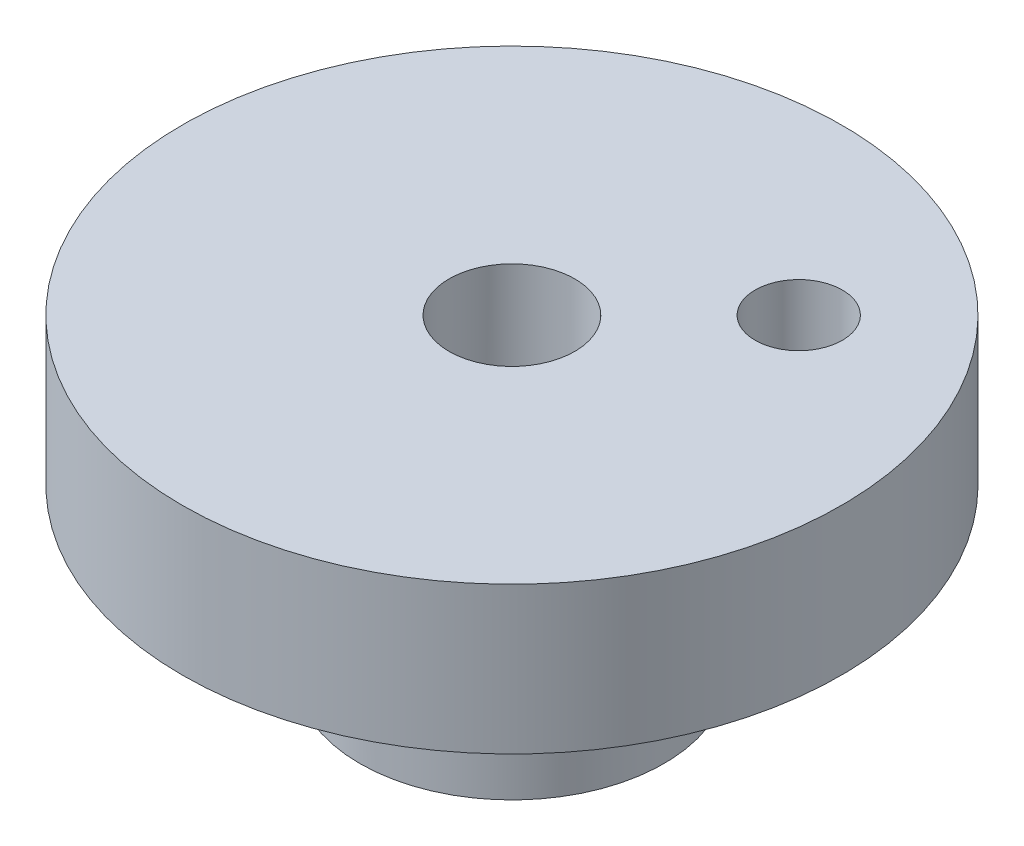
ISO-10303-21;
HEADER;
FILE_DESCRIPTION(('STEP AP214'),'2;1');
FILE_NAME('part.step','',(''),(''),'','','');
FILE_SCHEMA(('AUTOMOTIVE_DESIGN { 1 0 10303 214 1 1 1 1 }'));
ENDSEC;
DATA;
#1=APPLICATION_CONTEXT('core data for automotive mechanical design processes');
#2=APPLICATION_PROTOCOL_DEFINITION('international standard','automotive_design',2000,#1);
#3=PRODUCT_CONTEXT('',#1,'mechanical');
#4=PRODUCT('Part','Part','',(#3));
#5=PRODUCT_RELATED_PRODUCT_CATEGORY('part','',(#4));
#6=PRODUCT_DEFINITION_FORMATION('','',#4);
#7=PRODUCT_DEFINITION_CONTEXT('part definition',#1,'design');
#8=PRODUCT_DEFINITION('design','',#6,#7);
#9=PRODUCT_DEFINITION_SHAPE('','',#8);
#10=(LENGTH_UNIT() NAMED_UNIT(*) SI_UNIT(.MILLI.,.METRE.));
#11=(NAMED_UNIT(*) PLANE_ANGLE_UNIT() SI_UNIT($,.RADIAN.));
#12=(NAMED_UNIT(*) SI_UNIT($,.STERADIAN.) SOLID_ANGLE_UNIT());
#13=UNCERTAINTY_MEASURE_WITH_UNIT(LENGTH_MEASURE(1.E-05),#10,'distance_accuracy_value','');
#14=(GEOMETRIC_REPRESENTATION_CONTEXT(3) GLOBAL_UNCERTAINTY_ASSIGNED_CONTEXT((#13)) GLOBAL_UNIT_ASSIGNED_CONTEXT((#10,
#11,#12)) REPRESENTATION_CONTEXT('',''));
#15=CARTESIAN_POINT('',(0.,0.,0.));
#16=DIRECTION('',(0.,0.,1.));
#17=DIRECTION('',(1.,0.,0.));
#18=AXIS2_PLACEMENT_3D('',#15,#16,#17);
#19=CARTESIAN_POINT('',(0.,4.1402,0.));
#20=DIRECTION('',(0.,-1.,0.));
#21=DIRECTION('',(0.,0.,-1.));
#22=AXIS2_PLACEMENT_3D('',#19,#20,#21);
#23=CYLINDRICAL_SURFACE('',#22,3.81);
#24=CARTESIAN_POINT('',(-3.64239896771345,2.032,-1.1176));
#25=CARTESIAN_POINT('',(-3.64239971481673,2.09330883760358,-1.1175990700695));
#26=CARTESIAN_POINT('',(-3.64396383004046,2.15462694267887,-1.11253795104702));
#27=CARTESIAN_POINT('',(-3.65002764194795,2.27547500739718,-1.09247642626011));
#28=CARTESIAN_POINT('',(-3.65452841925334,2.33500430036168,-1.07747236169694));
#29=CARTESIAN_POINT('',(-3.66591290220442,2.45050812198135,-1.03807458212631));
#30=CARTESIAN_POINT('',(-3.67279277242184,2.50648820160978,-1.01369597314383));
#31=CARTESIAN_POINT('',(-3.68815512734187,2.61357667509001,-0.956290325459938));
#32=CARTESIAN_POINT('',(-3.6966378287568,2.66468440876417,-0.923262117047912));
#33=CARTESIAN_POINT('',(-3.71453785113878,2.76212366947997,-0.848425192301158));
#34=CARTESIAN_POINT('',(-3.7239744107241,2.80828598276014,-0.806400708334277));
#35=CARTESIAN_POINT('',(-3.74255419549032,2.89301926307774,-0.715226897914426));
#36=CARTESIAN_POINT('',(-3.75169738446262,2.93158929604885,-0.666076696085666));
#37=CARTESIAN_POINT('',(-3.76887797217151,3.00077182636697,-0.5608492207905));
#38=CARTESIAN_POINT('',(-3.77689005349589,3.03121268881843,-0.504654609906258));
#39=CARTESIAN_POINT('',(-3.79068274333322,3.08214747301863,-0.387669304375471));
#40=CARTESIAN_POINT('',(-3.79646381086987,3.10264344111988,-0.326879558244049));
#41=CARTESIAN_POINT('',(-3.80500699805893,3.13254922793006,-0.204199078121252));
#42=CARTESIAN_POINT('',(-3.80784756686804,3.14224767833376,-0.142384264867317));
#43=CARTESIAN_POINT('',(-3.81046555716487,3.15119482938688,-0.0179439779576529));
#44=CARTESIAN_POINT('',(-3.81024359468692,3.15044563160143,0.0446813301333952));
#45=CARTESIAN_POINT('',(-3.8068174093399,3.13871448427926,0.166943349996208));
#46=CARTESIAN_POINT('',(-3.80370423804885,3.12804494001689,0.226612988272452));
#47=CARTESIAN_POINT('',(-3.79495541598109,3.09728510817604,0.343274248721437));
#48=CARTESIAN_POINT('',(-3.78931960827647,3.07719423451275,0.400265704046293));
#49=CARTESIAN_POINT('',(-3.77603098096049,3.02794481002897,0.510706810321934));
#50=CARTESIAN_POINT('',(-3.7683560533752,2.99868619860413,0.564109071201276));
#51=CARTESIAN_POINT('',(-3.75180600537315,2.93201046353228,0.665347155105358));
#52=CARTESIAN_POINT('',(-3.74293061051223,2.8945914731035,0.713181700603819));
#53=CARTESIAN_POINT('',(-3.72454526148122,2.81102872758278,0.803791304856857));
#54=CARTESIAN_POINT('',(-3.71502397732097,2.76461385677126,0.846314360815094));
#55=CARTESIAN_POINT('',(-3.69670837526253,2.66521757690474,0.923042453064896));
#56=CARTESIAN_POINT('',(-3.68791412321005,2.61223557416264,0.95724673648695));
#57=CARTESIAN_POINT('',(-3.67199583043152,2.5005702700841,1.01661385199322));
#58=CARTESIAN_POINT('',(-3.66488719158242,2.44184084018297,1.04169434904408));
#59=CARTESIAN_POINT('',(-3.65332914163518,2.3207358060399,1.0815366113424));
#60=CARTESIAN_POINT('',(-3.64887890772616,2.25836133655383,1.09630156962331));
#61=CARTESIAN_POINT('',(-3.64332105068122,2.13412669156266,1.11463032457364));
#62=CARTESIAN_POINT('',(-3.64209961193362,2.07232785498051,1.11857570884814));
#63=CARTESIAN_POINT('',(-3.64282359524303,1.94895038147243,1.11621597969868));
#64=CARTESIAN_POINT('',(-3.64476859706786,1.88737171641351,1.10991222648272));
#65=CARTESIAN_POINT('',(-3.65149496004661,1.76774828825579,1.08757232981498));
#66=CARTESIAN_POINT('',(-3.65620564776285,1.70965390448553,1.0717784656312));
#67=CARTESIAN_POINT('',(-3.66786024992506,1.59694243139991,1.0311858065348));
#68=CARTESIAN_POINT('',(-3.67480449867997,1.54232586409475,1.00638566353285));
#69=CARTESIAN_POINT('',(-3.69036715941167,1.43655913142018,0.947750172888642));
#70=CARTESIAN_POINT('',(-3.69902422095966,1.38553512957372,0.913697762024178));
#71=CARTESIAN_POINT('',(-3.71695245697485,1.28978595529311,0.837784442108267));
#72=CARTESIAN_POINT('',(-3.72622377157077,1.24506222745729,0.795921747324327));
#73=CARTESIAN_POINT('',(-3.74473819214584,1.16153197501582,0.703788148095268));
#74=CARTESIAN_POINT('',(-3.75396836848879,1.12299509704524,0.653269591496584));
#75=CARTESIAN_POINT('',(-3.77102446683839,1.05494122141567,0.546264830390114));
#76=CARTESIAN_POINT('',(-3.77885046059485,1.02542376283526,0.48977893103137));
#77=CARTESIAN_POINT('',(-3.79216751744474,0.976530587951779,0.372825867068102));
#78=CARTESIAN_POINT('',(-3.79767611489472,0.957078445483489,0.312392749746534));
#79=CARTESIAN_POINT('',(-3.80581517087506,0.928665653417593,0.18892578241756));
#80=CARTESIAN_POINT('',(-3.80844641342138,0.919702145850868,0.125892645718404));
#81=CARTESIAN_POINT('',(-3.81048876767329,0.91273059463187,0.00151219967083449));
#82=CARTESIAN_POINT('',(-3.81001507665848,0.914330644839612,-0.0598115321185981));
#83=CARTESIAN_POINT('',(-3.8061700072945,0.927509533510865,-0.181279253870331));
#84=CARTESIAN_POINT('',(-3.80279878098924,0.939087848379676,-0.241423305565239));
#85=CARTESIAN_POINT('',(-3.79356830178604,0.971656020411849,-0.358249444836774));
#86=CARTESIAN_POINT('',(-3.78773393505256,0.992551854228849,-0.414959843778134));
#87=CARTESIAN_POINT('',(-3.77418156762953,1.04307808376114,-0.524100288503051));
#88=CARTESIAN_POINT('',(-3.76646326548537,1.07270987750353,-0.576529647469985));
#89=CARTESIAN_POINT('',(-3.74965987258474,1.1409315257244,-0.677382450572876));
#90=CARTESIAN_POINT('',(-3.74053987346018,1.17977024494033,-0.725631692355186));
#91=CARTESIAN_POINT('',(-3.7220783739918,1.26485019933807,-0.815059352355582));
#92=CARTESIAN_POINT('',(-3.71273681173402,1.31109352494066,-0.85623576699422));
#93=CARTESIAN_POINT('',(-3.69458194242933,1.41123147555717,-0.931508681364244));
#94=CARTESIAN_POINT('',(-3.6857908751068,1.46530468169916,-0.965373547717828));
#95=CARTESIAN_POINT('',(-3.67007895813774,1.57862667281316,-1.02349019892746));
#96=CARTESIAN_POINT('',(-3.66315713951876,1.63787275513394,-1.04774696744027));
#97=CARTESIAN_POINT('',(-3.65271098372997,1.75255645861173,-1.0835623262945));
#98=CARTESIAN_POINT('',(-3.64887937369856,1.8076024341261,-1.0962924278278));
#99=CARTESIAN_POINT('',(-3.64372324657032,1.91909648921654,-1.11331093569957));
#100=CARTESIAN_POINT('',(-3.6423982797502,1.97554431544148,-1.11760085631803));
#101=CARTESIAN_POINT('',(-3.64239896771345,2.032,-1.1176));
#102=B_SPLINE_CURVE_WITH_KNOTS('',3,(#24,#25,#26,#27,#28,#29,#30,#31,#32,#33,#34,#35,#36,#37,
#38,#39,#40,#41,#42,#43,#44,#45,#46,#47,#48,#49,#50,#51,#52,#53,#54,#55,#56,#57,#58,#59,#60,#61,
#62,#63,#64,#65,#66,#67,#68,#69,#70,#71,#72,#73,#74,#75,#76,#77,#78,#79,#80,#81,#82,#83,#84,#85,
#86,#87,#88,#89,#90,#91,#92,#93,#94,#95,#96,#97,#98,#99,#100,#101),.UNSPECIFIED.,.T.,.F.,(4,2,2,
2,2,2,2,2,2,2,2,2,2,2,2,2,2,2,2,2,2,2,2,2,2,2,2,2,2,2,2,2,2,2,2,2,2,2,4),(0.,0.183718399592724,
0.367504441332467,0.550995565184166,0.734511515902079,0.923055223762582,1.11162211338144,
1.30390183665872,1.49614197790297,1.68310974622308,1.87003990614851,2.05127579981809,
2.23252296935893,2.41582162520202,2.59916225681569,2.78927190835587,2.97939875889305,
3.17120112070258,3.36294408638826,3.54783192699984,3.73269523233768,3.91302843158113,
4.0933886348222,4.27841289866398,4.46347951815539,4.65518148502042,4.84687365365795,
5.03708811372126,5.22725073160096,5.41039903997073,5.59353773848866,5.77486879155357,
5.95622887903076,6.1432019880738,6.33022797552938,6.52251286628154,6.71469788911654,
6.88390366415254,7.05307907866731),.UNSPECIFIED.);
#103=CARTESIAN_POINT('',(-3.64239896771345,2.032,-1.1176));
#104=VERTEX_POINT('',#103);
#105=EDGE_CURVE('E81',#104,#104,#102,.T.);
#106=ORIENTED_EDGE('',*,*,#105,.T.);
#107=EDGE_LOOP('',(#106));
#108=FACE_BOUND('',#107,.T.);
#109=CARTESIAN_POINT('',(3.64239896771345,2.032,-1.1176));
#110=CARTESIAN_POINT('',(3.64239971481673,1.97069116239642,-1.1175990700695));
#111=CARTESIAN_POINT('',(3.64396383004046,1.90937305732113,-1.11253795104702));
#112=CARTESIAN_POINT('',(3.65002764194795,1.78852499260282,-1.09247642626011));
#113=CARTESIAN_POINT('',(3.65452841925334,1.72899569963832,-1.07747236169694));
#114=CARTESIAN_POINT('',(3.66591290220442,1.61349187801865,-1.03807458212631));
#115=CARTESIAN_POINT('',(3.67279277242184,1.55751179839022,-1.01369597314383));
#116=CARTESIAN_POINT('',(3.68815512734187,1.45042332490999,-0.956290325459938));
#117=CARTESIAN_POINT('',(3.6966378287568,1.39931559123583,-0.923262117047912));
#118=CARTESIAN_POINT('',(3.71453785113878,1.30187633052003,-0.848425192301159));
#119=CARTESIAN_POINT('',(3.7239744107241,1.25571401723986,-0.806400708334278));
#120=CARTESIAN_POINT('',(3.74255419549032,1.17098073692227,-0.715226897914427));
#121=CARTESIAN_POINT('',(3.75169738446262,1.13241070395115,-0.666076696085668));
#122=CARTESIAN_POINT('',(3.76887797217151,1.06322817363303,-0.560849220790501));
#123=CARTESIAN_POINT('',(3.77689005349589,1.03278731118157,-0.504654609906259));
#124=CARTESIAN_POINT('',(3.79068274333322,0.981852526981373,-0.387669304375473));
#125=CARTESIAN_POINT('',(3.79646381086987,0.961356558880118,-0.326879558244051));
#126=CARTESIAN_POINT('',(3.80500699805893,0.931450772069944,-0.204199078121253));
#127=CARTESIAN_POINT('',(3.80784756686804,0.921752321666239,-0.142384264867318));
#128=CARTESIAN_POINT('',(3.81046555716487,0.912805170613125,-0.0179439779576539));
#129=CARTESIAN_POINT('',(3.81024359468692,0.913554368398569,0.0446813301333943));
#130=CARTESIAN_POINT('',(3.8068174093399,0.925285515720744,0.166943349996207));
#131=CARTESIAN_POINT('',(3.80370423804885,0.93595505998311,0.226612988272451));
#132=CARTESIAN_POINT('',(3.79495541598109,0.966714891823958,0.343274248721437));
#133=CARTESIAN_POINT('',(3.78931960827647,0.986805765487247,0.400265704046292));
#134=CARTESIAN_POINT('',(3.77603098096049,1.03605518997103,0.510706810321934));
#135=CARTESIAN_POINT('',(3.7683560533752,1.06531380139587,0.564109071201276));
#136=CARTESIAN_POINT('',(3.75180600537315,1.13198953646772,0.665347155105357));
#137=CARTESIAN_POINT('',(3.74293061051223,1.1694085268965,0.713181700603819));
#138=CARTESIAN_POINT('',(3.72454526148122,1.25297127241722,0.803791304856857));
#139=CARTESIAN_POINT('',(3.71502397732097,1.29938614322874,0.846314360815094));
#140=CARTESIAN_POINT('',(3.69670837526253,1.39878242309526,0.923042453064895));
#141=CARTESIAN_POINT('',(3.68791412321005,1.45176442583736,0.95724673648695));
#142=CARTESIAN_POINT('',(3.67199583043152,1.5634297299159,1.01661385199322));
#143=CARTESIAN_POINT('',(3.66488719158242,1.62215915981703,1.04169434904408));
#144=CARTESIAN_POINT('',(3.65332914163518,1.74326419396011,1.0815366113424));
#145=CARTESIAN_POINT('',(3.64887890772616,1.80563866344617,1.09630156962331));
#146=CARTESIAN_POINT('',(3.64332105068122,1.92987330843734,1.11463032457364));
#147=CARTESIAN_POINT('',(3.64209961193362,1.99167214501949,1.11857570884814));
#148=CARTESIAN_POINT('',(3.64282359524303,2.11504961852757,1.11621597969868));
#149=CARTESIAN_POINT('',(3.64476859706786,2.17662828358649,1.10991222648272));
#150=CARTESIAN_POINT('',(3.65149496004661,2.29625171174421,1.08757232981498));
#151=CARTESIAN_POINT('',(3.65620564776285,2.35434609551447,1.0717784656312));
#152=CARTESIAN_POINT('',(3.66786024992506,2.46705756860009,1.0311858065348));
#153=CARTESIAN_POINT('',(3.67480449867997,2.52167413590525,1.00638566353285));
#154=CARTESIAN_POINT('',(3.69036715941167,2.62744086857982,0.947750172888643));
#155=CARTESIAN_POINT('',(3.69902422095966,2.67846487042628,0.913697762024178));
#156=CARTESIAN_POINT('',(3.71695245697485,2.77421404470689,0.837784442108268));
#157=CARTESIAN_POINT('',(3.72622377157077,2.81893777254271,0.795921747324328));
#158=CARTESIAN_POINT('',(3.74473819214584,2.90246802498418,0.703788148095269));
#159=CARTESIAN_POINT('',(3.75396836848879,2.94100490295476,0.653269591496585));
#160=CARTESIAN_POINT('',(3.77102446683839,3.00905877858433,0.546264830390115));
#161=CARTESIAN_POINT('',(3.77885046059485,3.03857623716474,0.489778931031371));
#162=CARTESIAN_POINT('',(3.79216751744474,3.08746941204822,0.372825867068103));
#163=CARTESIAN_POINT('',(3.79767611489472,3.10692155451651,0.312392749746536));
#164=CARTESIAN_POINT('',(3.80581517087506,3.13533434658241,0.188925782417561));
#165=CARTESIAN_POINT('',(3.80844641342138,3.14429785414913,0.125892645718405));
#166=CARTESIAN_POINT('',(3.81048876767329,3.15126940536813,0.00151219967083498));
#167=CARTESIAN_POINT('',(3.81001507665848,3.14966935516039,-0.0598115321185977));
#168=CARTESIAN_POINT('',(3.8061700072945,3.13649046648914,-0.18127925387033));
#169=CARTESIAN_POINT('',(3.80279878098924,3.12491215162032,-0.241423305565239));
#170=CARTESIAN_POINT('',(3.79356830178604,3.09234397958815,-0.358249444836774));
#171=CARTESIAN_POINT('',(3.78773393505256,3.07144814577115,-0.414959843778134));
#172=CARTESIAN_POINT('',(3.77418156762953,3.02092191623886,-0.524100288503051));
#173=CARTESIAN_POINT('',(3.76646326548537,2.99129012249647,-0.576529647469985));
#174=CARTESIAN_POINT('',(3.74965987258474,2.9230684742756,-0.677382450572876));
#175=CARTESIAN_POINT('',(3.74053987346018,2.88422975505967,-0.725631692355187));
#176=CARTESIAN_POINT('',(3.7220783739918,2.79914980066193,-0.815059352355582));
#177=CARTESIAN_POINT('',(3.71273681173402,2.75290647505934,-0.856235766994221));
#178=CARTESIAN_POINT('',(3.69458194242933,2.65276852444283,-0.931508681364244));
#179=CARTESIAN_POINT('',(3.6857908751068,2.59869531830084,-0.965373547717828));
#180=CARTESIAN_POINT('',(3.67007895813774,2.48537332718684,-1.02349019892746));
#181=CARTESIAN_POINT('',(3.66315713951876,2.42612724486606,-1.04774696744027));
#182=CARTESIAN_POINT('',(3.65271098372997,2.31144354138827,-1.0835623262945));
#183=CARTESIAN_POINT('',(3.64887937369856,2.2563975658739,-1.0962924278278));
#184=CARTESIAN_POINT('',(3.64372324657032,2.14490351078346,-1.11331093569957));
#185=CARTESIAN_POINT('',(3.6423982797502,2.08845568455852,-1.11760085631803));
#186=CARTESIAN_POINT('',(3.64239896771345,2.032,-1.1176));
#187=B_SPLINE_CURVE_WITH_KNOTS('',3,(#109,#110,#111,#112,#113,#114,#115,#116,#117,#118,#119,
#120,#121,#122,#123,#124,#125,#126,#127,#128,#129,#130,#131,#132,#133,#134,#135,#136,#137,#138,
#139,#140,#141,#142,#143,#144,#145,#146,#147,#148,#149,#150,#151,#152,#153,#154,#155,#156,#157,
#158,#159,#160,#161,#162,#163,#164,#165,#166,#167,#168,#169,#170,#171,#172,#173,#174,#175,#176,
#177,#178,#179,#180,#181,#182,#183,#184,#185,#186),.UNSPECIFIED.,.T.,.F.,(4,2,2,2,2,2,2,2,2,2,2,
2,2,2,2,2,2,2,2,2,2,2,2,2,2,2,2,2,2,2,2,2,2,2,2,2,2,2,4),(0.,0.183718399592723,
0.367504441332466,0.550995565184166,0.734511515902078,0.92305522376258,1.11162211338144,
1.30390183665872,1.49614197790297,1.68310974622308,1.87003990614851,2.05127579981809,
2.23252296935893,2.41582162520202,2.59916225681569,2.78927190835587,2.97939875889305,
3.17120112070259,3.36294408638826,3.54783192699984,3.73269523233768,3.91302843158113,
4.0933886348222,4.27841289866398,4.46347951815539,4.65518148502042,4.84687365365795,
5.03708811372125,5.22725073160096,5.41039903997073,5.59353773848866,5.77486879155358,
5.95622887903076,6.1432019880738,6.33022797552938,6.52251286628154,6.71469788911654,
6.88390366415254,7.05307907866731),.UNSPECIFIED.);
#188=CARTESIAN_POINT('',(3.64239896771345,2.032,-1.1176));
#189=VERTEX_POINT('',#188);
#190=EDGE_CURVE('E53',#189,#189,#187,.T.);
#191=ORIENTED_EDGE('',*,*,#190,.T.);
#192=EDGE_LOOP('',(#191));
#193=FACE_BOUND('',#192,.T.);
#194=CARTESIAN_POINT('',(0.,3.1496,-3.81));
#195=CARTESIAN_POINT('',(-0.0613729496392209,3.14959909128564,-3.80999937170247));
#196=CARTESIAN_POINT('',(-0.12275513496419,3.14452775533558,-3.80850280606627));
#197=CARTESIAN_POINT('',(-0.243735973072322,3.1244219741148,-3.80267872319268));
#198=CARTESIAN_POINT('',(-0.303334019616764,3.10938418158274,-3.7983502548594));
#199=CARTESIAN_POINT('',(-0.418983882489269,3.0698878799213,-3.78733737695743));
#200=CARTESIAN_POINT('',(-0.475040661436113,3.04544291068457,-3.78065635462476));
#201=CARTESIAN_POINT('',(-0.582259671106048,2.98788058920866,-3.76563518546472));
#202=CARTESIAN_POINT('',(-0.633421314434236,2.95476219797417,-3.75729483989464));
#203=CARTESIAN_POINT('',(-0.730808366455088,2.87983055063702,-3.73958977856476));
#204=CARTESIAN_POINT('',(-0.776879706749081,2.83782185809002,-3.73020477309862));
#205=CARTESIAN_POINT('',(-0.8614349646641,2.74671886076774,-3.71159104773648));
#206=CARTESIAN_POINT('',(-0.899917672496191,2.69762342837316,-3.70236235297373));
#207=CARTESIAN_POINT('',(-0.969001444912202,2.59245245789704,-3.684893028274));
#208=CARTESIAN_POINT('',(-0.999416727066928,2.53625028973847,-3.67667769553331));
#209=CARTESIAN_POINT('',(-1.05030222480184,2.41924915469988,-3.66246750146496));
#210=CARTESIAN_POINT('',(-1.07077471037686,2.35845124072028,-3.65647213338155));
#211=CARTESIAN_POINT('',(-1.10064217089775,2.23570981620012,-3.64759172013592));
#212=CARTESIAN_POINT('',(-1.11032023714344,2.1738410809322,-3.6446273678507));
#213=CARTESIAN_POINT('',(-1.11920785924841,2.04929253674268,-3.64190846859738));
#214=CARTESIAN_POINT('',(-1.11841982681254,1.98661291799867,-3.64215318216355));
#215=CARTESIAN_POINT('',(-1.10662047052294,1.86450407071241,-3.64575433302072));
#216=CARTESIAN_POINT('',(-1.09596120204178,1.80503714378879,-3.64900360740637));
#217=CARTESIAN_POINT('',(-1.06528972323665,1.68877562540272,-3.65807477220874));
#218=CARTESIAN_POINT('',(-1.04527662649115,1.63198128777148,-3.66389690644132));
#219=CARTESIAN_POINT('',(-0.996200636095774,1.52180430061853,-3.67754509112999));
#220=CARTESIAN_POINT('',(-0.967021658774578,1.4684766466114,-3.68539660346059));
#221=CARTESIAN_POINT('',(-0.900522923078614,1.36735550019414,-3.70220633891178));
#222=CARTESIAN_POINT('',(-0.863201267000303,1.31956330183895,-3.71116481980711));
#223=CARTESIAN_POINT('',(-0.779717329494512,1.22886972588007,-3.7296161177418));
#224=CARTESIAN_POINT('',(-0.733262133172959,1.18623896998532,-3.73911600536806));
#225=CARTESIAN_POINT('',(-0.633743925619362,1.10931157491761,-3.75726274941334));
#226=CARTESIAN_POINT('',(-0.580680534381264,1.07501541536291,-3.76590955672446));
#227=CARTESIAN_POINT('',(-0.468975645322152,1.01557609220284,-3.78144905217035));
#228=CARTESIAN_POINT('',(-0.410301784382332,0.990490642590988,-3.78833060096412));
#229=CARTESIAN_POINT('',(-0.289319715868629,0.950622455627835,-3.79948395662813));
#230=CARTESIAN_POINT('',(-0.227012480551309,0.935836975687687,-3.80375645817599));
#231=CARTESIAN_POINT('',(-0.102834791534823,0.917433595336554,-3.80910144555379));
#232=CARTESIAN_POINT('',(-0.041023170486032,0.913448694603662,-3.81027905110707));
#233=CARTESIAN_POINT('',(0.0823884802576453,0.91573409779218,-3.80960867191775));
#234=CARTESIAN_POINT('',(0.143988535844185,0.922003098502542,-3.80776107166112));
#235=CARTESIAN_POINT('',(0.263858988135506,0.94432060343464,-3.80131652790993));
#236=CARTESIAN_POINT('',(0.322172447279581,0.960156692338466,-3.79677934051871));
#237=CARTESIAN_POINT('',(0.435303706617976,1.00090514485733,-3.78547823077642));
#238=CARTESIAN_POINT('',(0.490121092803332,1.02581858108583,-3.778714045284));
#239=CARTESIAN_POINT('',(0.596070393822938,1.08464387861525,-3.76347327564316));
#240=CARTESIAN_POINT('',(0.64709195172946,1.11874518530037,-3.75496165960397));
#241=CARTESIAN_POINT('',(0.742814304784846,1.19474642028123,-3.73720495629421));
#242=CARTESIAN_POINT('',(0.787513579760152,1.23664821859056,-3.72795969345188));
#243=CARTESIAN_POINT('',(0.870924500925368,1.32878360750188,-3.70937756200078));
#244=CARTESIAN_POINT('',(0.90937538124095,1.37925536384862,-3.70004859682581));
#245=CARTESIAN_POINT('',(0.977277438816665,1.48613703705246,-3.68269758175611));
#246=CARTESIAN_POINT('',(1.00672889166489,1.5425467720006,-3.67467549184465));
#247=CARTESIAN_POINT('',(1.05558751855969,1.65949604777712,-3.66093975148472));
#248=CARTESIAN_POINT('',(1.07504480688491,1.72001322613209,-3.65521461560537));
#249=CARTESIAN_POINT('',(1.10343973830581,1.84366275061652,-3.6467443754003));
#250=CARTESIAN_POINT('',(1.11238078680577,1.90679424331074,-3.64399830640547));
#251=CARTESIAN_POINT('',(1.11926498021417,2.03117991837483,-3.64188923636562));
#252=CARTESIAN_POINT('',(1.11763188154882,2.09240875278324,-3.64239587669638));
#253=CARTESIAN_POINT('',(1.10441970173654,2.21367759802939,-3.64642342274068));
#254=CARTESIAN_POINT('',(1.09284098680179,2.27371765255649,-3.64994421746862));
#255=CARTESIAN_POINT('',(1.06033431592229,2.39024534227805,-3.65951788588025));
#256=CARTESIAN_POINT('',(1.0395138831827,2.44676554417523,-3.66554158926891));
#257=CARTESIAN_POINT('',(0.989198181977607,2.55555550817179,-3.67943814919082));
#258=CARTESIAN_POINT('',(0.959701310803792,2.60782448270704,-3.68731134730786));
#259=CARTESIAN_POINT('',(0.891660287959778,2.70860660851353,-3.70436379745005));
#260=CARTESIAN_POINT('',(0.852835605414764,2.75692426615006,-3.71357911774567));
#261=CARTESIAN_POINT('',(0.767751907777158,2.84649612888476,-3.73209721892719));
#262=CARTESIAN_POINT('',(0.721490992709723,2.88774852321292,-3.74140002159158));
#263=CARTESIAN_POINT('',(0.621313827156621,2.96314741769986,-3.75935173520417));
#264=CARTESIAN_POINT('',(0.567221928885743,2.99706710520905,-3.76797560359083));
#265=CARTESIAN_POINT('',(0.453850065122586,3.05528171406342,-3.78330322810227));
#266=CARTESIAN_POINT('',(0.394572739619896,3.07958149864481,-3.79000795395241));
#267=CARTESIAN_POINT('',(0.279789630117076,3.11547730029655,-3.80009662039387));
#268=CARTESIAN_POINT('',(0.22467261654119,3.12823972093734,-3.80378048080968));
#269=CARTESIAN_POINT('',(0.11303953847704,3.14530085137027,-3.80873227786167));
#270=CARTESIAN_POINT('',(0.0565236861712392,3.14960083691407,-3.81000057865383));
#271=CARTESIAN_POINT('',(0.,3.1496,-3.81));
#272=B_SPLINE_CURVE_WITH_KNOTS('',3,(#194,#195,#196,#197,#198,#199,#200,#201,#202,#203,#204,
#205,#206,#207,#208,#209,#210,#211,#212,#213,#214,#215,#216,#217,#218,#219,#220,#221,#222,#223,
#224,#225,#226,#227,#228,#229,#230,#231,#232,#233,#234,#235,#236,#237,#238,#239,#240,#241,#242,
#243,#244,#245,#246,#247,#248,#249,#250,#251,#252,#253,#254,#255,#256,#257,#258,#259,#260,#261,
#262,#263,#264,#265,#266,#267,#268,#269,#270,#271),.UNSPECIFIED.,.T.,.F.,(4,2,2,2,2,2,2,2,2,2,2,
2,2,2,2,2,2,2,2,2,2,2,2,2,2,2,2,2,2,2,2,2,2,2,2,2,2,2,4),(0.,0.183911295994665,
0.367884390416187,0.551593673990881,0.735324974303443,0.923617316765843,1.11193965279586,
1.30428203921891,1.49658049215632,1.68370765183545,1.87079169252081,2.05145020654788,
2.23212584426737,2.41518880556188,2.59829447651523,2.78869327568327,2.97910302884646,
3.17068630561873,3.3622185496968,3.54715581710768,3.7320695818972,3.91302135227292,
4.09399451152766,4.27903022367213,4.46411035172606,4.65559591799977,4.84707561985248,
5.03758556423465,5.22803380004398,5.41089844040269,5.59375634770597,5.77454038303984,
5.95535783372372,6.14250414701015,6.32969835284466,6.52204446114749,6.71429320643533,
6.88369865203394,7.05307855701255),.UNSPECIFIED.);
#273=CARTESIAN_POINT('',(0.,3.1496,-3.81));
#274=VERTEX_POINT('',#273);
#275=EDGE_CURVE('E92',#274,#274,#272,.T.);
#276=ORIENTED_EDGE('',*,*,#275,.T.);
#277=EDGE_LOOP('',(#276));
#278=FACE_BOUND('',#277,.T.);
#279=CARTESIAN_POINT('',(1.1176,2.032,3.64239896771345));
#280=CARTESIAN_POINT('',(1.1175990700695,1.97069116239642,3.64239971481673));
#281=CARTESIAN_POINT('',(1.11253795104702,1.90937305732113,3.64396383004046));
#282=CARTESIAN_POINT('',(1.09247642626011,1.78852499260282,3.65002764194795));
#283=CARTESIAN_POINT('',(1.07747236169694,1.72899569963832,3.65452841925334));
#284=CARTESIAN_POINT('',(1.03807458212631,1.61349187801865,3.66591290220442));
#285=CARTESIAN_POINT('',(1.01369597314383,1.55751179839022,3.67279277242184));
#286=CARTESIAN_POINT('',(0.956290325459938,1.45042332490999,3.68815512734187));
#287=CARTESIAN_POINT('',(0.923262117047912,1.39931559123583,3.6966378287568));
#288=CARTESIAN_POINT('',(0.848425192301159,1.30187633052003,3.71453785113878));
#289=CARTESIAN_POINT('',(0.806400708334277,1.25571401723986,3.7239744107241));
#290=CARTESIAN_POINT('',(0.715226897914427,1.17098073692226,3.74255419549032));
#291=CARTESIAN_POINT('',(0.666076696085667,1.13241070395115,3.75169738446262));
#292=CARTESIAN_POINT('',(0.560849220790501,1.06322817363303,3.76887797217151));
#293=CARTESIAN_POINT('',(0.504654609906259,1.03278731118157,3.77689005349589));
#294=CARTESIAN_POINT('',(0.387669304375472,0.981852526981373,3.79068274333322));
#295=CARTESIAN_POINT('',(0.32687955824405,0.961356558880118,3.79646381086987));
#296=CARTESIAN_POINT('',(0.204199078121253,0.931450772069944,3.80500699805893));
#297=CARTESIAN_POINT('',(0.142384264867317,0.921752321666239,3.80784756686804));
#298=CARTESIAN_POINT('',(0.0179439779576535,0.912805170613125,3.81046555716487));
#299=CARTESIAN_POINT('',(-0.0446813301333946,0.913554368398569,3.81024359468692));
#300=CARTESIAN_POINT('',(-0.166943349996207,0.925285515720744,3.8068174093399));
#301=CARTESIAN_POINT('',(-0.226612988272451,0.935955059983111,3.80370423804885));
#302=CARTESIAN_POINT('',(-0.343274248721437,0.966714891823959,3.79495541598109));
#303=CARTESIAN_POINT('',(-0.400265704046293,0.986805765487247,3.78931960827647));
#304=CARTESIAN_POINT('',(-0.510706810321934,1.03605518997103,3.77603098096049));
#305=CARTESIAN_POINT('',(-0.564109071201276,1.06531380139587,3.7683560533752));
#306=CARTESIAN_POINT('',(-0.665347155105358,1.13198953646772,3.75180600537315));
#307=CARTESIAN_POINT('',(-0.71318170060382,1.1694085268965,3.74293061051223));
#308=CARTESIAN_POINT('',(-0.803791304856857,1.25297127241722,3.72454526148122));
#309=CARTESIAN_POINT('',(-0.846314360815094,1.29938614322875,3.71502397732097));
#310=CARTESIAN_POINT('',(-0.923042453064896,1.39878242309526,3.69670837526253));
#311=CARTESIAN_POINT('',(-0.95724673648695,1.45176442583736,3.68791412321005));
#312=CARTESIAN_POINT('',(-1.01661385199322,1.5634297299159,3.67199583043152));
#313=CARTESIAN_POINT('',(-1.04169434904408,1.62215915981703,3.66488719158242));
#314=CARTESIAN_POINT('',(-1.0815366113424,1.74326419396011,3.65332914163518));
#315=CARTESIAN_POINT('',(-1.09630156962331,1.80563866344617,3.64887890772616));
#316=CARTESIAN_POINT('',(-1.11463032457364,1.92987330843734,3.64332105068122));
#317=CARTESIAN_POINT('',(-1.11857570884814,1.99167214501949,3.64209961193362));
#318=CARTESIAN_POINT('',(-1.11621597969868,2.11504961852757,3.64282359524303));
#319=CARTESIAN_POINT('',(-1.10991222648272,2.17662828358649,3.64476859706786));
#320=CARTESIAN_POINT('',(-1.08757232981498,2.29625171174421,3.65149496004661));
#321=CARTESIAN_POINT('',(-1.0717784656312,2.35434609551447,3.65620564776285));
#322=CARTESIAN_POINT('',(-1.0311858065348,2.46705756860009,3.66786024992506));
#323=CARTESIAN_POINT('',(-1.00638566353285,2.52167413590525,3.67480449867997));
#324=CARTESIAN_POINT('',(-0.947750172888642,2.62744086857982,3.69036715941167));
#325=CARTESIAN_POINT('',(-0.913697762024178,2.67846487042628,3.69902422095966));
#326=CARTESIAN_POINT('',(-0.837784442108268,2.77421404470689,3.71695245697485));
#327=CARTESIAN_POINT('',(-0.795921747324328,2.81893777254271,3.72622377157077));
#328=CARTESIAN_POINT('',(-0.703788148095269,2.90246802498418,3.74473819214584));
#329=CARTESIAN_POINT('',(-0.653269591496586,2.94100490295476,3.75396836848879));
#330=CARTESIAN_POINT('',(-0.546264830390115,3.00905877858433,3.77102446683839));
#331=CARTESIAN_POINT('',(-0.489778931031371,3.03857623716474,3.77885046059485));
#332=CARTESIAN_POINT('',(-0.372825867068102,3.08746941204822,3.79216751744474));
#333=CARTESIAN_POINT('',(-0.312392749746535,3.10692155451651,3.79767611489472));
#334=CARTESIAN_POINT('',(-0.18892578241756,3.13533434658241,3.80581517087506));
#335=CARTESIAN_POINT('',(-0.125892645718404,3.14429785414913,3.80844641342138));
#336=CARTESIAN_POINT('',(-0.00151219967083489,3.15126940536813,3.81048876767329));
#337=CARTESIAN_POINT('',(0.0598115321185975,3.14966935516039,3.81001507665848));
#338=CARTESIAN_POINT('',(0.18127925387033,3.13649046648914,3.8061700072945));
#339=CARTESIAN_POINT('',(0.241423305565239,3.12491215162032,3.80279878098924));
#340=CARTESIAN_POINT('',(0.358249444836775,3.09234397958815,3.79356830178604));
#341=CARTESIAN_POINT('',(0.414959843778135,3.07144814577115,3.78773393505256));
#342=CARTESIAN_POINT('',(0.524100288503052,3.02092191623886,3.77418156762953));
#343=CARTESIAN_POINT('',(0.576529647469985,2.99129012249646,3.76646326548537));
#344=CARTESIAN_POINT('',(0.677382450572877,2.9230684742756,3.74965987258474));
#345=CARTESIAN_POINT('',(0.725631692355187,2.88422975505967,3.74053987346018));
#346=CARTESIAN_POINT('',(0.815059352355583,2.79914980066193,3.7220783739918));
#347=CARTESIAN_POINT('',(0.856235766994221,2.75290647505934,3.71273681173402));
#348=CARTESIAN_POINT('',(0.931508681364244,2.65276852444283,3.69458194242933));
#349=CARTESIAN_POINT('',(0.965373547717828,2.59869531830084,3.6857908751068));
#350=CARTESIAN_POINT('',(1.02349019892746,2.48537332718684,3.67007895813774));
#351=CARTESIAN_POINT('',(1.04774696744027,2.42612724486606,3.66315713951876));
#352=CARTESIAN_POINT('',(1.0835623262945,2.31144354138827,3.65271098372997));
#353=CARTESIAN_POINT('',(1.0962924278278,2.2563975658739,3.64887937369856));
#354=CARTESIAN_POINT('',(1.11331093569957,2.14490351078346,3.64372324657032));
#355=CARTESIAN_POINT('',(1.11760085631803,2.08845568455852,3.6423982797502));
#356=CARTESIAN_POINT('',(1.1176,2.032,3.64239896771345));
#357=B_SPLINE_CURVE_WITH_KNOTS('',3,(#279,#280,#281,#282,#283,#284,#285,#286,#287,#288,#289,
#290,#291,#292,#293,#294,#295,#296,#297,#298,#299,#300,#301,#302,#303,#304,#305,#306,#307,#308,
#309,#310,#311,#312,#313,#314,#315,#316,#317,#318,#319,#320,#321,#322,#323,#324,#325,#326,#327,
#328,#329,#330,#331,#332,#333,#334,#335,#336,#337,#338,#339,#340,#341,#342,#343,#344,#345,#346,
#347,#348,#349,#350,#351,#352,#353,#354,#355,#356),.UNSPECIFIED.,.T.,.F.,(4,2,2,2,2,2,2,2,2,2,2,
2,2,2,2,2,2,2,2,2,2,2,2,2,2,2,2,2,2,2,2,2,2,2,2,2,2,2,4),(0.,0.183718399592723,
0.367504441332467,0.550995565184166,0.734511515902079,0.923055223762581,1.11162211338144,
1.30390183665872,1.49614197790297,1.68310974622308,1.87003990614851,2.05127579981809,
2.23252296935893,2.41582162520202,2.59916225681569,2.78927190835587,2.97939875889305,
3.17120112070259,3.36294408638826,3.54783192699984,3.73269523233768,3.91302843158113,
4.0933886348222,4.27841289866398,4.46347951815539,4.65518148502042,4.84687365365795,
5.03708811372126,5.22725073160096,5.41039903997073,5.59353773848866,5.77486879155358,
5.95622887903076,6.1432019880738,6.33022797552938,6.52251286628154,6.71469788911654,
6.88390366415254,7.05307907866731),.UNSPECIFIED.);
#358=CARTESIAN_POINT('',(1.1176,2.032,3.64239896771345));
#359=VERTEX_POINT('',#358);
#360=EDGE_CURVE('E87',#359,#359,#357,.T.);
#361=ORIENTED_EDGE('',*,*,#360,.T.);
#362=EDGE_LOOP('',(#361));
#363=FACE_BOUND('',#362,.T.);
#364=CARTESIAN_POINT('',(0.,4.1402,0.));
#365=DIRECTION('',(0.,1.,0.));
#366=DIRECTION('',(0.,0.,1.));
#367=AXIS2_PLACEMENT_3D('',#364,#365,#366);
#368=CIRCLE('',#367,3.81);
#369=CARTESIAN_POINT('',(0.,4.1402,3.81));
#370=VERTEX_POINT('',#369);
#371=EDGE_CURVE('E39',#370,#370,#368,.T.);
#372=ORIENTED_EDGE('',*,*,#371,.F.);
#373=EDGE_LOOP('',(#372));
#374=FACE_BOUND('',#373,.T.);
#375=CARTESIAN_POINT('',(0.,0.,0.));
#376=DIRECTION('',(0.,1.,0.));
#377=DIRECTION('',(0.,0.,1.));
#378=AXIS2_PLACEMENT_3D('',#375,#376,#377);
#379=CIRCLE('',#378,3.81);
#380=CARTESIAN_POINT('',(0.,0.,3.81));
#381=VERTEX_POINT('',#380);
#382=EDGE_CURVE('E43',#381,#381,#379,.T.);
#383=ORIENTED_EDGE('',*,*,#382,.T.);
#384=EDGE_LOOP('',(#383));
#385=FACE_BOUND('',#384,.T.);
#386=ADVANCED_FACE('F28',(#108,#193,#278,#363,#374,#385),#23,.T.);
#387=CARTESIAN_POINT('',(0.,0.,0.));
#388=DIRECTION('',(0.,1.,0.));
#389=DIRECTION('',(0.,0.,1.));
#390=AXIS2_PLACEMENT_3D('',#387,#388,#389);
#391=PLANE('',#390);
#392=CARTESIAN_POINT('',(0.,0.,0.));
#393=DIRECTION('',(0.,-1.,0.));
#394=DIRECTION('',(0.,0.,-1.));
#395=AXIS2_PLACEMENT_3D('',#392,#393,#394);
#396=CIRCLE('',#395,2.3876);
#397=CARTESIAN_POINT('',(0.,0.,-2.3876));
#398=VERTEX_POINT('',#397);
#399=EDGE_CURVE('E107',#398,#398,#396,.T.);
#400=ORIENTED_EDGE('',*,*,#399,.F.);
#401=EDGE_LOOP('',(#400));
#402=FACE_BOUND('',#401,.T.);
#403=ORIENTED_EDGE('',*,*,#382,.F.);
#404=EDGE_LOOP('',(#403));
#405=FACE_BOUND('',#404,.T.);
#406=ADVANCED_FACE('F138',(#402,#405),#391,.F.);
#407=CARTESIAN_POINT('',(0.,4.1402,0.));
#408=DIRECTION('',(0.,1.,0.));
#409=DIRECTION('',(0.,0.,1.));
#410=AXIS2_PLACEMENT_3D('',#407,#408,#409);
#411=PLANE('',#410);
#412=CARTESIAN_POINT('',(3.59210244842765,4.1402,-3.59210244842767));
#413=DIRECTION('',(0.,1.,0.));
#414=DIRECTION('',(0.,0.,1.));
#415=AXIS2_PLACEMENT_3D('',#412,#413,#414);
#416=CIRCLE('',#415,1.0922);
#417=CARTESIAN_POINT('',(3.59210244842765,4.1402,-2.49990244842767));
#418=VERTEX_POINT('',#417);
#419=EDGE_CURVE('E101',#418,#418,#416,.T.);
#420=ORIENTED_EDGE('',*,*,#419,.T.);
#421=EDGE_LOOP('',(#420));
#422=FACE_BOUND('',#421,.T.);
#423=CARTESIAN_POINT('',(0.,4.1402,0.));
#424=DIRECTION('',(0.,1.,0.));
#425=DIRECTION('',(0.,0.,1.));
#426=AXIS2_PLACEMENT_3D('',#423,#424,#425);
#427=CIRCLE('',#426,8.255);
#428=CARTESIAN_POINT('',(0.,4.1402,8.255));
#429=VERTEX_POINT('',#428);
#430=EDGE_CURVE('E113',#429,#429,#427,.T.);
#431=ORIENTED_EDGE('',*,*,#430,.F.);
#432=EDGE_LOOP('',(#431));
#433=FACE_BOUND('',#432,.T.);
#434=ORIENTED_EDGE('',*,*,#371,.T.);
#435=EDGE_LOOP('',(#434));
#436=FACE_BOUND('',#435,.T.);
#437=ADVANCED_FACE('F147',(#422,#433,#436),#411,.F.);
#438=CARTESIAN_POINT('',(0.,7.8232,0.));
#439=DIRECTION('',(0.,-1.,0.));
#440=DIRECTION('',(0.,0.,-1.));
#441=AXIS2_PLACEMENT_3D('',#438,#439,#440);
#442=CYLINDRICAL_SURFACE('',#441,8.255);
#443=CARTESIAN_POINT('',(0.,7.8232,0.));
#444=DIRECTION('',(0.,1.,0.));
#445=DIRECTION('',(0.,0.,1.));
#446=AXIS2_PLACEMENT_3D('',#443,#444,#445);
#447=CIRCLE('',#446,8.255);
#448=CARTESIAN_POINT('',(0.,7.8232,8.255));
#449=VERTEX_POINT('',#448);
#450=EDGE_CURVE('E116',#449,#449,#447,.T.);
#451=ORIENTED_EDGE('',*,*,#450,.F.);
#452=EDGE_LOOP('',(#451));
#453=FACE_BOUND('',#452,.T.);
#454=ORIENTED_EDGE('',*,*,#430,.T.);
#455=EDGE_LOOP('',(#454));
#456=FACE_BOUND('',#455,.T.);
#457=ADVANCED_FACE('F152',(#453,#456),#442,.T.);
#458=CARTESIAN_POINT('',(0.,7.8232,0.));
#459=DIRECTION('',(0.,1.,0.));
#460=DIRECTION('',(0.,0.,1.));
#461=AXIS2_PLACEMENT_3D('',#458,#459,#460);
#462=PLANE('',#461);
#463=CARTESIAN_POINT('',(3.59210244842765,7.8232,-3.59210244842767));
#464=DIRECTION('',(0.,1.,0.));
#465=DIRECTION('',(0.,0.,1.));
#466=AXIS2_PLACEMENT_3D('',#463,#464,#465);
#467=CIRCLE('',#466,1.0922);
#468=CARTESIAN_POINT('',(3.59210244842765,7.8232,-2.49990244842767));
#469=VERTEX_POINT('',#468);
#470=EDGE_CURVE('E98',#469,#469,#467,.T.);
#471=ORIENTED_EDGE('',*,*,#470,.F.);
#472=EDGE_LOOP('',(#471));
#473=FACE_BOUND('',#472,.T.);
#474=CARTESIAN_POINT('',(0.,7.8232,0.));
#475=DIRECTION('',(0.,1.,0.));
#476=DIRECTION('',(0.,0.,1.));
#477=AXIS2_PLACEMENT_3D('',#474,#475,#476);
#478=CIRCLE('',#477,1.5748);
#479=CARTESIAN_POINT('',(0.,7.8232,1.5748));
#480=VERTEX_POINT('',#479);
#481=EDGE_CURVE('E104',#480,#480,#478,.T.);
#482=ORIENTED_EDGE('',*,*,#481,.F.);
#483=EDGE_LOOP('',(#482));
#484=FACE_BOUND('',#483,.T.);
#485=ORIENTED_EDGE('',*,*,#450,.T.);
#486=EDGE_LOOP('',(#485));
#487=FACE_BOUND('',#486,.T.);
#488=ADVANCED_FACE('F158',(#473,#484,#487),#462,.T.);
#489=CARTESIAN_POINT('',(0.,4.064,0.));
#490=DIRECTION('',(0.,-1.,0.));
#491=DIRECTION('',(0.,0.,-1.));
#492=AXIS2_PLACEMENT_3D('',#489,#490,#491);
#493=CYLINDRICAL_SURFACE('',#492,2.3876);
#494=CARTESIAN_POINT('',(-2.10988246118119,2.032,-1.1176));
#495=CARTESIAN_POINT('',(-2.10988646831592,1.97320713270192,-1.11759654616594));
#496=CARTESIAN_POINT('',(-2.11237630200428,1.91432749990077,-1.11293050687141));
#497=CARTESIAN_POINT('',(-2.12198984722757,1.79833110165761,-1.09448389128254));
#498=CARTESIAN_POINT('',(-2.12912449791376,1.74121883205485,-1.08068179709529));
#499=CARTESIAN_POINT('',(-2.14702606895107,1.63064844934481,-1.04465850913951));
#500=CARTESIAN_POINT('',(-2.15777550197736,1.57717420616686,-1.02247778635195));
#501=CARTESIAN_POINT('',(-2.18166875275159,1.47471886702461,-0.970449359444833));
#502=CARTESIAN_POINT('',(-2.1948124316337,1.42573751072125,-0.94060209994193));
#503=CARTESIAN_POINT('',(-2.22317090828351,1.32976290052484,-0.871569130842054));
#504=CARTESIAN_POINT('',(-2.23846665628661,1.28316503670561,-0.831866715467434));
#505=CARTESIAN_POINT('',(-2.2687484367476,1.19698778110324,-0.745329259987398));
#506=CARTESIAN_POINT('',(-2.28373432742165,1.1574115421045,-0.698491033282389));
#507=CARTESIAN_POINT('',(-2.31273684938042,1.08419032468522,-0.595725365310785));
#508=CARTESIAN_POINT('',(-2.32664874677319,1.05101511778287,-0.539430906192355));
#509=CARTESIAN_POINT('',(-2.3509098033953,0.994783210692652,-0.421288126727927));
#510=CARTESIAN_POINT('',(-2.36126093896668,0.971720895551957,-0.359442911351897));
#511=CARTESIAN_POINT('',(-2.37665485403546,0.937881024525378,-0.236128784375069));
#512=CARTESIAN_POINT('',(-2.38199364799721,0.926414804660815,-0.17488661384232));
#513=CARTESIAN_POINT('',(-2.38785443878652,0.913841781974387,-0.0511316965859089));
#514=CARTESIAN_POINT('',(-2.38837894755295,0.912729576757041,0.0113803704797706));
#515=CARTESIAN_POINT('',(-2.38470634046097,0.920591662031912,0.130792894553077));
#516=CARTESIAN_POINT('',(-2.38086710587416,0.928801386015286,0.187757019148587));
#517=CARTESIAN_POINT('',(-2.3694196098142,0.953729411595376,0.299388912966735));
#518=CARTESIAN_POINT('',(-2.36181106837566,0.970448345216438,0.354056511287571));
#519=CARTESIAN_POINT('',(-2.34339447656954,1.01207543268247,0.460545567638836));
#520=CARTESIAN_POINT('',(-2.33254049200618,1.03710176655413,0.512312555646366));
#521=CARTESIAN_POINT('',(-2.30864487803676,1.09449412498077,0.611045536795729));
#522=CARTESIAN_POINT('',(-2.29560244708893,1.12686284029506,0.658009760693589));
#523=CARTESIAN_POINT('',(-2.26727322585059,1.20121483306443,0.750079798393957));
#524=CARTESIAN_POINT('',(-2.25188988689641,1.2437833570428,0.794683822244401));
#525=CARTESIAN_POINT('',(-2.22137641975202,1.33573173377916,0.876370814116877));
#526=CARTESIAN_POINT('',(-2.20624645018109,1.38511568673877,0.913449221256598));
#527=CARTESIAN_POINT('',(-2.17715824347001,1.49236561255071,0.980832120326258));
#528=CARTESIAN_POINT('',(-2.16329712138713,1.5505331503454,1.01070247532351));
#529=CARTESIAN_POINT('',(-2.13957157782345,1.67188318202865,1.06001140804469));
#530=CARTESIAN_POINT('',(-2.12970346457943,1.7350609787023,1.07945962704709));
#531=CARTESIAN_POINT('',(-2.11607744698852,1.8596168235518,1.1059191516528));
#532=CARTESIAN_POINT('',(-2.11191687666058,1.92077462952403,1.11375364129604));
#533=CARTESIAN_POINT('',(-2.10902251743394,2.04365942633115,1.1192276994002));
#534=CARTESIAN_POINT('',(-2.11028584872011,2.10538609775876,1.11687267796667));
#535=CARTESIAN_POINT('',(-2.11767317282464,2.22176561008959,1.1027893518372));
#536=CARTESIAN_POINT('',(-2.12334980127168,2.27655536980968,1.09192308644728));
#537=CARTESIAN_POINT('',(-2.1382983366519,2.38345541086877,1.0623494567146));
#538=CARTESIAN_POINT('',(-2.14757125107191,2.43556493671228,1.0436398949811));
#539=CARTESIAN_POINT('',(-2.16917760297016,2.53833078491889,0.997980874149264));
#540=CARTESIAN_POINT('',(-2.18163227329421,2.58880979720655,0.970691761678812));
#541=CARTESIAN_POINT('',(-2.20806568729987,2.68474887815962,0.908958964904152));
#542=CARTESIAN_POINT('',(-2.22204518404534,2.73020644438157,0.874511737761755));
#543=CARTESIAN_POINT('',(-2.25176385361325,2.81991950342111,0.795094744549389));
#544=CARTESIAN_POINT('',(-2.26753054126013,2.86351957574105,0.749391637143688));
#545=CARTESIAN_POINT('',(-2.29770817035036,2.94260226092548,0.651012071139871));
#546=CARTESIAN_POINT('',(-2.31211882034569,2.97808313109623,0.598334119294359));
#547=CARTESIAN_POINT('',(-2.338265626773,3.04031184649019,0.486313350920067));
#548=CARTESIAN_POINT('',(-2.34995809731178,3.06691968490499,0.42688188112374));
#549=CARTESIAN_POINT('',(-2.36902556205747,3.10951747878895,0.303685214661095));
#550=CARTESIAN_POINT('',(-2.37640386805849,3.12551558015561,0.239923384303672));
#551=CARTESIAN_POINT('',(-2.38554233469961,3.14522784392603,0.115649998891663));
#552=CARTESIAN_POINT('',(-2.3877217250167,3.14985958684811,0.0553142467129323));
#553=CARTESIAN_POINT('',(-2.38746784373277,3.14931812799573,-0.0652954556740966));
#554=CARTESIAN_POINT('',(-2.3850358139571,3.14414756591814,-0.125569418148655));
#555=CARTESIAN_POINT('',(-2.37607369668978,3.1247896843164,-0.241009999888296));
#556=CARTESIAN_POINT('',(-2.36976730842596,3.11109405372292,-0.296278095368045));
#557=CARTESIAN_POINT('',(-2.35385494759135,3.07568507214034,-0.403670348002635));
#558=CARTESIAN_POINT('',(-2.34424844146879,3.05397042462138,-0.455793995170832));
#559=CARTESIAN_POINT('',(-2.32208522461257,3.0020774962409,-0.55804557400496));
#560=CARTESIAN_POINT('',(-2.30941460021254,2.97156042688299,-0.607976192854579));
#561=CARTESIAN_POINT('',(-2.28252450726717,2.90337545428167,-0.702226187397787));
#562=CARTESIAN_POINT('',(-2.26830434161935,2.86570432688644,-0.746543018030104));
#563=CARTESIAN_POINT('',(-2.23830368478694,2.78041803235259,-0.832391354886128));
#564=CARTESIAN_POINT('',(-2.2224958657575,2.73222000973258,-0.873336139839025));
#565=CARTESIAN_POINT('',(-2.19224366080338,2.62928108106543,-0.946721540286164));
#566=CARTESIAN_POINT('',(-2.17780025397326,2.57453553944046,-0.979156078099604));
#567=CARTESIAN_POINT('',(-2.15188876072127,2.45889289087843,-1.03487678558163));
#568=CARTESIAN_POINT('',(-2.14046557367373,2.39791982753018,-1.05802728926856));
#569=CARTESIAN_POINT('',(-2.12262174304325,2.27229607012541,-1.09339584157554));
#570=CARTESIAN_POINT('',(-2.11618431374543,2.20765850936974,-1.10565059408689));
#571=CARTESIAN_POINT('',(-2.11180979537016,2.12407587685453,-1.11395424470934));
#572=CARTESIAN_POINT('',(-2.11108893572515,2.10569763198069,-1.11531978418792));
#573=CARTESIAN_POINT('',(-2.11012462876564,2.06888244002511,-1.11714322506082));
#574=CARTESIAN_POINT('',(-2.10988120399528,2.05044549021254,-1.11760108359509));
#575=CARTESIAN_POINT('',(-2.10988246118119,2.032,-1.1176));
#576=B_SPLINE_CURVE_WITH_KNOTS('',3,(#494,#495,#496,#497,#498,#499,#500,#501,#502,#503,#504,
#505,#506,#507,#508,#509,#510,#511,#512,#513,#514,#515,#516,#517,#518,#519,#520,#521,#522,#523,
#524,#525,#526,#527,#528,#529,#530,#531,#532,#533,#534,#535,#536,#537,#538,#539,#540,#541,#542,
#543,#544,#545,#546,#547,#548,#549,#550,#551,#552,#553,#554,#555,#556,#557,#558,#559,#560,#561,
#562,#563,#564,#565,#566,#567,#568,#569,#570,#571,#572,#573,#574,#575),.UNSPECIFIED.,.T.,.F.,(4,
2,2,2,2,2,2,2,2,2,2,2,2,2,2,2,2,2,2,2,2,2,2,2,2,2,2,2,2,2,2,2,2,2,2,2,2,2,2,2,4),(0.,
0.176301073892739,0.353018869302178,0.528893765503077,0.704758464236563,0.893252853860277,
1.08183166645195,1.28121550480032,1.48048849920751,1.66707410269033,1.85356234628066,
2.02579442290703,2.19803929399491,2.37284775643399,2.54772038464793,2.73753711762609,
2.92746854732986,3.12694624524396,3.32623909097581,3.5105889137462,3.69484086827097,
3.86252203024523,4.03025020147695,4.20569920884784,4.38123526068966,4.57565548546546,
4.77011740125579,4.96751664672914,5.16476415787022,5.34547139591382,5.52612997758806,
5.69722731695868,5.86835233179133,6.04722789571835,6.22618426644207,6.42086212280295,
6.61567863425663,6.81324642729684,7.01014613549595,7.06545567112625,7.12076781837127),.UNSPECIFIED.);
#577=CARTESIAN_POINT('',(-2.10988246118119,2.032,-1.1176));
#578=VERTEX_POINT('',#577);
#579=EDGE_CURVE('E46',#578,#578,#576,.T.);
#580=ORIENTED_EDGE('',*,*,#579,.T.);
#581=EDGE_LOOP('',(#580));
#582=FACE_BOUND('',#581,.T.);
#583=CARTESIAN_POINT('',(2.10988246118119,2.032,-1.1176));
#584=CARTESIAN_POINT('',(2.10988646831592,2.09079286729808,-1.11759654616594));
#585=CARTESIAN_POINT('',(2.11237630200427,2.14967250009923,-1.11293050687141));
#586=CARTESIAN_POINT('',(2.12198984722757,2.26566889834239,-1.09448389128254));
#587=CARTESIAN_POINT('',(2.12912449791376,2.32278116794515,-1.08068179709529));
#588=CARTESIAN_POINT('',(2.14702606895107,2.43335155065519,-1.04465850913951));
#589=CARTESIAN_POINT('',(2.15777550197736,2.48682579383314,-1.02247778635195));
#590=CARTESIAN_POINT('',(2.18166875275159,2.58928113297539,-0.970449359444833));
#591=CARTESIAN_POINT('',(2.1948124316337,2.63826248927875,-0.94060209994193));
#592=CARTESIAN_POINT('',(2.22317090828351,2.73423709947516,-0.871569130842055));
#593=CARTESIAN_POINT('',(2.23846665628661,2.78083496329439,-0.831866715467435));
#594=CARTESIAN_POINT('',(2.2687484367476,2.86701221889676,-0.745329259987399));
#595=CARTESIAN_POINT('',(2.28373432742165,2.9065884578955,-0.698491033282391));
#596=CARTESIAN_POINT('',(2.31273684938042,2.97980967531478,-0.595725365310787));
#597=CARTESIAN_POINT('',(2.32664874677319,3.01298488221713,-0.539430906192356));
#598=CARTESIAN_POINT('',(2.3509098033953,3.06921678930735,-0.421288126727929));
#599=CARTESIAN_POINT('',(2.36126093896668,3.09227910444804,-0.359442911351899));
#600=CARTESIAN_POINT('',(2.37665485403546,3.12611897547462,-0.236128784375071));
#601=CARTESIAN_POINT('',(2.38199364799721,3.13758519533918,-0.174886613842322));
#602=CARTESIAN_POINT('',(2.38785443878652,3.15015821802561,-0.0511316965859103));
#603=CARTESIAN_POINT('',(2.38837894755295,3.15127042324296,0.0113803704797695));
#604=CARTESIAN_POINT('',(2.38470634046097,3.14340833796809,0.130792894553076));
#605=CARTESIAN_POINT('',(2.38086710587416,3.13519861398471,0.187757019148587));
#606=CARTESIAN_POINT('',(2.3694196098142,3.11027058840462,0.299388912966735));
#607=CARTESIAN_POINT('',(2.36181106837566,3.09355165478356,0.354056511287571));
#608=CARTESIAN_POINT('',(2.34339447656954,3.05192456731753,0.460545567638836));
#609=CARTESIAN_POINT('',(2.33254049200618,3.02689823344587,0.512312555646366));
#610=CARTESIAN_POINT('',(2.30864487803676,2.96950587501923,0.611045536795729));
#611=CARTESIAN_POINT('',(2.29560244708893,2.93713715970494,0.65800976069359));
#612=CARTESIAN_POINT('',(2.26727322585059,2.86278516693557,0.750079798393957));
#613=CARTESIAN_POINT('',(2.25188988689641,2.82021664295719,0.794683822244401));
#614=CARTESIAN_POINT('',(2.22137641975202,2.72826826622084,0.876370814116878));
#615=CARTESIAN_POINT('',(2.20624645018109,2.67888431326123,0.913449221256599));
#616=CARTESIAN_POINT('',(2.17715824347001,2.57163438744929,0.980832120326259));
#617=CARTESIAN_POINT('',(2.16329712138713,2.5134668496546,1.01070247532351));
#618=CARTESIAN_POINT('',(2.13957157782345,2.39211681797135,1.06001140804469));
#619=CARTESIAN_POINT('',(2.12970346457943,2.3289390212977,1.07945962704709));
#620=CARTESIAN_POINT('',(2.11607744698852,2.20438317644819,1.1059191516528));
#621=CARTESIAN_POINT('',(2.11191687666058,2.14322537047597,1.11375364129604));
#622=CARTESIAN_POINT('',(2.10902251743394,2.02034057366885,1.1192276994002));
#623=CARTESIAN_POINT('',(2.11028584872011,1.95861390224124,1.11687267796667));
#624=CARTESIAN_POINT('',(2.11767317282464,1.84223438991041,1.1027893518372));
#625=CARTESIAN_POINT('',(2.12334980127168,1.78744463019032,1.09192308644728));
#626=CARTESIAN_POINT('',(2.1382983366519,1.68054458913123,1.0623494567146));
#627=CARTESIAN_POINT('',(2.14757125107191,1.62843506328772,1.0436398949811));
#628=CARTESIAN_POINT('',(2.16917760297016,1.52566921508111,0.997980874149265));
#629=CARTESIAN_POINT('',(2.1816322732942,1.47519020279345,0.970691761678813));
#630=CARTESIAN_POINT('',(2.20806568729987,1.37925112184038,0.908958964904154));
#631=CARTESIAN_POINT('',(2.22204518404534,1.33379355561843,0.874511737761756));
#632=CARTESIAN_POINT('',(2.25176385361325,1.24408049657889,0.79509474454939));
#633=CARTESIAN_POINT('',(2.26753054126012,1.20048042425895,0.749391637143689));
#634=CARTESIAN_POINT('',(2.29770817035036,1.12139773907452,0.651012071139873));
#635=CARTESIAN_POINT('',(2.31211882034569,1.08591686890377,0.598334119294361));
#636=CARTESIAN_POINT('',(2.338265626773,1.02368815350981,0.486313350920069));
#637=CARTESIAN_POINT('',(2.34995809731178,0.997080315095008,0.426881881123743));
#638=CARTESIAN_POINT('',(2.36902556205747,0.954482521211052,0.303685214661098));
#639=CARTESIAN_POINT('',(2.37640386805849,0.938484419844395,0.239923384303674));
#640=CARTESIAN_POINT('',(2.38554233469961,0.918772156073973,0.115649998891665));
#641=CARTESIAN_POINT('',(2.3877217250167,0.914140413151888,0.055314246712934));
#642=CARTESIAN_POINT('',(2.38746784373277,0.914681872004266,-0.0652954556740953));
#643=CARTESIAN_POINT('',(2.3850358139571,0.919852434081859,-0.125569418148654));
#644=CARTESIAN_POINT('',(2.37607369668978,0.939210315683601,-0.241009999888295));
#645=CARTESIAN_POINT('',(2.36976730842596,0.952905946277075,-0.296278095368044));
#646=CARTESIAN_POINT('',(2.35385494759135,0.988314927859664,-0.403670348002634));
#647=CARTESIAN_POINT('',(2.34424844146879,1.01002957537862,-0.455793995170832));
#648=CARTESIAN_POINT('',(2.32208522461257,1.0619225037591,-0.55804557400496));
#649=CARTESIAN_POINT('',(2.30941460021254,1.09243957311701,-0.607976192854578));
#650=CARTESIAN_POINT('',(2.28252450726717,1.16062454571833,-0.702226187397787));
#651=CARTESIAN_POINT('',(2.26830434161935,1.19829567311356,-0.746543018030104));
#652=CARTESIAN_POINT('',(2.23830368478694,1.28358196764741,-0.832391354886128));
#653=CARTESIAN_POINT('',(2.2224958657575,1.33177999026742,-0.873336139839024));
#654=CARTESIAN_POINT('',(2.19224366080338,1.43471891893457,-0.946721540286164));
#655=CARTESIAN_POINT('',(2.17780025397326,1.48946446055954,-0.979156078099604));
#656=CARTESIAN_POINT('',(2.15188876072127,1.60510710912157,-1.03487678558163));
#657=CARTESIAN_POINT('',(2.14046557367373,1.66608017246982,-1.05802728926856));
#658=CARTESIAN_POINT('',(2.12262174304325,1.79170392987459,-1.09339584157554));
#659=CARTESIAN_POINT('',(2.11618431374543,1.85634149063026,-1.10565059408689));
#660=CARTESIAN_POINT('',(2.11180979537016,1.93992412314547,-1.11395424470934));
#661=CARTESIAN_POINT('',(2.11108893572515,1.95830236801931,-1.11531978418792));
#662=CARTESIAN_POINT('',(2.11012462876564,1.99511755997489,-1.11714322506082));
#663=CARTESIAN_POINT('',(2.10988120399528,2.01355450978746,-1.11760108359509));
#664=CARTESIAN_POINT('',(2.10988246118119,2.032,-1.1176));
#665=B_SPLINE_CURVE_WITH_KNOTS('',3,(#583,#584,#585,#586,#587,#588,#589,#590,#591,#592,#593,
#594,#595,#596,#597,#598,#599,#600,#601,#602,#603,#604,#605,#606,#607,#608,#609,#610,#611,#612,
#613,#614,#615,#616,#617,#618,#619,#620,#621,#622,#623,#624,#625,#626,#627,#628,#629,#630,#631,
#632,#633,#634,#635,#636,#637,#638,#639,#640,#641,#642,#643,#644,#645,#646,#647,#648,#649,#650,
#651,#652,#653,#654,#655,#656,#657,#658,#659,#660,#661,#662,#663,#664),.UNSPECIFIED.,.T.,.F.,(4,
2,2,2,2,2,2,2,2,2,2,2,2,2,2,2,2,2,2,2,2,2,2,2,2,2,2,2,2,2,2,2,2,2,2,2,2,2,2,2,4),(0.,
0.176301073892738,0.353018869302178,0.528893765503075,0.704758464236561,0.893252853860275,
1.08183166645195,1.28121550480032,1.48048849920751,1.66707410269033,1.85356234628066,
2.02579442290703,2.19803929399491,2.37284775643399,2.54772038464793,2.73753711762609,
2.92746854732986,3.12694624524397,3.32623909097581,3.5105889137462,3.69484086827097,
3.86252203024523,4.03025020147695,4.20569920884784,4.38123526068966,4.57565548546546,
4.77011740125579,4.96751664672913,5.16476415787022,5.34547139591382,5.52612997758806,
5.69722731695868,5.86835233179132,6.04722789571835,6.22618426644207,6.42086212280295,
6.61567863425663,6.81324642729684,7.01014613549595,7.06545567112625,7.12076781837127),.UNSPECIFIED.);
#666=CARTESIAN_POINT('',(2.10988246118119,2.032,-1.1176));
#667=VERTEX_POINT('',#666);
#668=EDGE_CURVE('E54',#667,#667,#665,.T.);
#669=ORIENTED_EDGE('',*,*,#668,.T.);
#670=EDGE_LOOP('',(#669));
#671=FACE_BOUND('',#670,.T.);
#672=CARTESIAN_POINT('',(0.,3.1496,-2.3876));
#673=CARTESIAN_POINT('',(0.0591945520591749,3.14959674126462,-2.38759725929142));
#674=CARTESIAN_POINT('',(0.11847267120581,3.14486936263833,-2.38537441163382));
#675=CARTESIAN_POINT('',(0.235304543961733,3.12615595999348,-2.37670252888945));
#676=CARTESIAN_POINT('',(0.292854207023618,3.11214954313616,-2.37024418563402));
#677=CARTESIAN_POINT('',(0.404356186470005,3.07553046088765,-2.35378298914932));
#678=CARTESIAN_POINT('',(0.458320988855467,3.05294973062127,-2.343793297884));
#679=CARTESIAN_POINT('',(0.561629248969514,2.99997474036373,-2.32120794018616));
#680=CARTESIAN_POINT('',(0.610973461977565,2.96958176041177,-2.30861270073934));
#681=CARTESIAN_POINT('',(0.706693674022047,2.89993267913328,-2.28119072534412));
#682=CARTESIAN_POINT('',(0.752757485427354,2.86028126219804,-2.26627939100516));
#683=CARTESIAN_POINT('',(0.837862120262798,2.77408440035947,-2.23621595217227));
#684=CARTESIAN_POINT('',(0.876898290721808,2.72753442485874,-2.22106369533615));
#685=CARTESIAN_POINT('',(0.949398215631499,2.62517647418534,-2.19109932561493));
#686=CARTESIAN_POINT('',(0.982327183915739,2.56896112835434,-2.17637500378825));
#687=CARTESIAN_POINT('',(1.03812564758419,2.45101450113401,-2.15032181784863));
#688=CARTESIAN_POINT('',(1.06100159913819,2.38928679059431,-2.13899077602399));
#689=CARTESIAN_POINT('',(1.09467644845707,2.26563206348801,-2.12194666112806));
#690=CARTESIAN_POINT('',(1.10608021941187,2.20391000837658,-2.11595438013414));
#691=CARTESIAN_POINT('',(1.11835836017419,2.0791608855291,-2.10949329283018));
#692=CARTESIAN_POINT('',(1.11924102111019,2.01613488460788,-2.10902013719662));
#693=CARTESIAN_POINT('',(1.11089955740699,1.89742840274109,-2.11342108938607));
#694=CARTESIAN_POINT('',(1.10269277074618,1.84165198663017,-2.11775701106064));
#695=CARTESIAN_POINT('',(1.07814543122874,1.73238497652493,-2.13035783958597));
#696=CARTESIAN_POINT('',(1.06180276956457,1.67889497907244,-2.13862376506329));
#697=CARTESIAN_POINT('',(1.02112809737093,1.57422908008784,-2.15834425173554));
#698=CARTESIAN_POINT('',(0.996620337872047,1.52313512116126,-2.16986802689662));
#699=CARTESIAN_POINT('',(0.940440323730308,1.42555548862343,-2.19480046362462));
#700=CARTESIAN_POINT('',(0.90876493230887,1.37907184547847,-2.20820994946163));
#701=CARTESIAN_POINT('',(0.835100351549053,1.28668275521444,-2.23717924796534));
#702=CARTESIAN_POINT('',(0.792362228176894,1.2413959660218,-2.25281388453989));
#703=CARTESIAN_POINT('',(0.699792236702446,1.1583942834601,-2.28326482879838));
#704=CARTESIAN_POINT('',(0.649957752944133,1.12068219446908,-2.2980808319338));
#705=CARTESIAN_POINT('',(0.542305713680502,1.05264816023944,-2.32588352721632));
#706=CARTESIAN_POINT('',(0.484265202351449,1.02264148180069,-2.33878506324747));
#707=CARTESIAN_POINT('',(0.363201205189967,0.973045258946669,-2.36061231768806));
#708=CARTESIAN_POINT('',(0.300181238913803,0.953448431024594,-2.36954081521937));
#709=CARTESIAN_POINT('',(0.176057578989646,0.926669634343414,-2.38185427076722));
#710=CARTESIAN_POINT('',(0.115168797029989,0.918661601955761,-2.38560707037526));
#711=CARTESIAN_POINT('',(-0.00719533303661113,0.91274780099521,-2.38837206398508));
#712=CARTESIAN_POINT('',(-0.0686704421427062,0.914838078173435,-2.38738611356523));
#713=CARTESIAN_POINT('',(-0.186166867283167,0.92853302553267,-2.38101069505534));
#714=CARTESIAN_POINT('',(-0.242280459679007,0.939501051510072,-2.37591596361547));
#715=CARTESIAN_POINT('',(-0.351778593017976,0.969687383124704,-2.36218796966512));
#716=CARTESIAN_POINT('',(-0.405162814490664,0.988906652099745,-2.35355429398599));
#717=CARTESIAN_POINT('',(-0.509554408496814,1.03562907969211,-2.33321753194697));
#718=CARTESIAN_POINT('',(-0.560439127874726,1.06336764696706,-2.3214286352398));
#719=CARTESIAN_POINT('',(-0.657011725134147,1.12608375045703,-2.29596765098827));
#720=CARTESIAN_POINT('',(-0.702697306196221,1.1610644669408,-2.2822947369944));
#721=CARTESIAN_POINT('',(-0.791837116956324,1.24085509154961,-2.25300212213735));
#722=CARTESIAN_POINT('',(-0.834738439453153,1.28626006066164,-2.23731711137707));
#723=CARTESIAN_POINT('',(-0.912525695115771,1.3837574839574,-2.20673544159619));
#724=CARTESIAN_POINT('',(-0.947407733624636,1.43585316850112,-2.19183916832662));
#725=CARTESIAN_POINT('',(-1.00920283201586,1.54749969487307,-2.16410063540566));
#726=CARTESIAN_POINT('',(-1.03581445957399,1.60724000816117,-2.15134251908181));
#727=CARTESIAN_POINT('',(-1.07832977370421,1.73114768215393,-2.13035447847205));
#728=CARTESIAN_POINT('',(-1.09424539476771,1.79531002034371,-2.1221195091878));
#729=CARTESIAN_POINT('',(-1.11359783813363,1.92000276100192,-2.11202318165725));
#730=CARTESIAN_POINT('',(-1.11803317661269,1.9803367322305,-2.10965269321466));
#731=CARTESIAN_POINT('',(-1.11710037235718,2.10089869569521,-2.11014742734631));
#732=CARTESIAN_POINT('',(-1.11173503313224,2.16112671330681,-2.11301115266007));
#733=CARTESIAN_POINT('',(-1.09225444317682,2.27512076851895,-2.12313889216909));
#734=CARTESIAN_POINT('',(-1.0788138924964,2.32903573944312,-2.13006270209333));
#735=CARTESIAN_POINT('',(-1.04432565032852,2.43381869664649,-2.14718098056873));
#736=CARTESIAN_POINT('',(-1.02327568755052,2.48468576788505,-2.15737642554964));
#737=CARTESIAN_POINT('',(-0.972580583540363,2.58563926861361,-2.18072173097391));
#738=CARTESIAN_POINT('',(-0.942457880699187,2.63545004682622,-2.1940227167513));
#739=CARTESIAN_POINT('',(-0.875052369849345,2.72961702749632,-2.22176617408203));
#740=CARTESIAN_POINT('',(-0.837766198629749,2.77397065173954,-2.23620917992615));
#741=CARTESIAN_POINT('',(-0.752646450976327,2.86061540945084,-2.26636130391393));
#742=CARTESIAN_POINT('',(-0.704127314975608,2.90224347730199,-2.28205062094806));
#743=CARTESIAN_POINT('',(-0.600281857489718,2.97686967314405,-2.31153749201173));
#744=CARTESIAN_POINT('',(-0.54495230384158,3.00986368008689,-2.32533414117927));
#745=CARTESIAN_POINT('',(-0.429108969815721,3.06593247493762,-2.34946422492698));
#746=CARTESIAN_POINT('',(-0.368621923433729,3.08905507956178,-2.35981429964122));
#747=CARTESIAN_POINT('',(-0.24408900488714,3.12452731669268,-2.37591378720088));
#748=CARTESIAN_POINT('',(-0.180054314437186,3.13690895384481,-2.38167686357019));
#749=CARTESIAN_POINT('',(-0.096255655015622,3.14561507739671,-2.38573715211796));
#750=CARTESIAN_POINT('',(-0.0770443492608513,3.14710777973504,-2.38643430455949));
#751=CARTESIAN_POINT('',(-0.0385583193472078,3.1491007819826,-2.38736617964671));
#752=CARTESIAN_POINT('',(-0.0192835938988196,3.14960106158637,-2.38760089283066));
#753=CARTESIAN_POINT('',(0.,3.1496,-2.3876));
#754=B_SPLINE_CURVE_WITH_KNOTS('',3,(#672,#673,#674,#675,#676,#677,#678,#679,#680,#681,#682,
#683,#684,#685,#686,#687,#688,#689,#690,#691,#692,#693,#694,#695,#696,#697,#698,#699,#700,#701,
#702,#703,#704,#705,#706,#707,#708,#709,#710,#711,#712,#713,#714,#715,#716,#717,#718,#719,#720,
#721,#722,#723,#724,#725,#726,#727,#728,#729,#730,#731,#732,#733,#734,#735,#736,#737,#738,#739,
#740,#741,#742,#743,#744,#745,#746,#747,#748,#749,#750,#751,#752,#753),.UNSPECIFIED.,.T.,.F.,(4,
2,2,2,2,2,2,2,2,2,2,2,2,2,2,2,2,2,2,2,2,2,2,2,2,2,2,2,2,2,2,2,2,2,2,2,2,2,2,2,4),(0.,
0.177504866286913,0.355401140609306,0.532641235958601,0.709852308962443,0.896803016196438,
1.08387705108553,1.283244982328,1.48248468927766,1.67056074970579,1.85848858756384,
2.02733053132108,2.19621626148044,2.36900128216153,2.54186206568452,2.73361886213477,
2.92544652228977,3.12418655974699,3.32278736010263,3.50638437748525,3.68990950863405,
3.86132968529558,4.0327698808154,4.20945416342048,4.38621619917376,4.57858071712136,
4.77103846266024,4.96985610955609,5.16845154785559,5.34908366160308,5.52966411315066,
5.69692275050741,5.86423135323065,6.04263915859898,6.22113093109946,6.41768763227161,
6.6143379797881,6.81002464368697,7.00512620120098,7.06295013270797,7.12077524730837),.UNSPECIFIED.);
#755=CARTESIAN_POINT('',(0.,3.1496,-2.3876));
#756=VERTEX_POINT('',#755);
#757=EDGE_CURVE('E93',#756,#756,#754,.T.);
#758=ORIENTED_EDGE('',*,*,#757,.T.);
#759=EDGE_LOOP('',(#758));
#760=FACE_BOUND('',#759,.T.);
#761=CARTESIAN_POINT('',(1.1176,2.032,2.10988246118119));
#762=CARTESIAN_POINT('',(1.11759654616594,2.09079286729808,2.10988646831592));
#763=CARTESIAN_POINT('',(1.11293050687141,2.14967250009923,2.11237630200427));
#764=CARTESIAN_POINT('',(1.09448389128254,2.26566889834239,2.12198984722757));
#765=CARTESIAN_POINT('',(1.08068179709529,2.32278116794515,2.12912449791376));
#766=CARTESIAN_POINT('',(1.04465850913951,2.43335155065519,2.14702606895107));
#767=CARTESIAN_POINT('',(1.02247778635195,2.48682579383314,2.15777550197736));
#768=CARTESIAN_POINT('',(0.970449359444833,2.58928113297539,2.18166875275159));
#769=CARTESIAN_POINT('',(0.94060209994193,2.63826248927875,2.1948124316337));
#770=CARTESIAN_POINT('',(0.871569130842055,2.73423709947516,2.22317090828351));
#771=CARTESIAN_POINT('',(0.831866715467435,2.78083496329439,2.23846665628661));
#772=CARTESIAN_POINT('',(0.745329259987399,2.86701221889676,2.2687484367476));
#773=CARTESIAN_POINT('',(0.698491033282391,2.9065884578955,2.28373432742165));
#774=CARTESIAN_POINT('',(0.595725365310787,2.97980967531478,2.31273684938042));
#775=CARTESIAN_POINT('',(0.539430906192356,3.01298488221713,2.32664874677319));
#776=CARTESIAN_POINT('',(0.421288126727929,3.06921678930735,2.3509098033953));
#777=CARTESIAN_POINT('',(0.359442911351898,3.09227910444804,2.36126093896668));
#778=CARTESIAN_POINT('',(0.236128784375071,3.12611897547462,2.37665485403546));
#779=CARTESIAN_POINT('',(0.174886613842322,3.13758519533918,2.38199364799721));
#780=CARTESIAN_POINT('',(0.0511316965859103,3.15015821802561,2.38785443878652));
#781=CARTESIAN_POINT('',(-0.0113803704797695,3.15127042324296,2.38837894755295));
#782=CARTESIAN_POINT('',(-0.130792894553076,3.14340833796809,2.38470634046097));
#783=CARTESIAN_POINT('',(-0.187757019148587,3.13519861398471,2.38086710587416));
#784=CARTESIAN_POINT('',(-0.299388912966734,3.11027058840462,2.3694196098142));
#785=CARTESIAN_POINT('',(-0.354056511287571,3.09355165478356,2.36181106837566));
#786=CARTESIAN_POINT('',(-0.460545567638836,3.05192456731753,2.34339447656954));
#787=CARTESIAN_POINT('',(-0.512312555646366,3.02689823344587,2.33254049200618));
#788=CARTESIAN_POINT('',(-0.611045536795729,2.96950587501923,2.30864487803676));
#789=CARTESIAN_POINT('',(-0.65800976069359,2.93713715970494,2.29560244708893));
#790=CARTESIAN_POINT('',(-0.750079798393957,2.86278516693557,2.26727322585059));
#791=CARTESIAN_POINT('',(-0.794683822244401,2.82021664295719,2.25188988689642));
#792=CARTESIAN_POINT('',(-0.876370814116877,2.72826826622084,2.22137641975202));
#793=CARTESIAN_POINT('',(-0.913449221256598,2.67888431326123,2.20624645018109));
#794=CARTESIAN_POINT('',(-0.980832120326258,2.57163438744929,2.17715824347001));
#795=CARTESIAN_POINT('',(-1.01070247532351,2.5134668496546,2.16329712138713));
#796=CARTESIAN_POINT('',(-1.06001140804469,2.39211681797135,2.13957157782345));
#797=CARTESIAN_POINT('',(-1.07945962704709,2.3289390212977,2.12970346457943));
#798=CARTESIAN_POINT('',(-1.1059191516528,2.2043831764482,2.11607744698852));
#799=CARTESIAN_POINT('',(-1.11375364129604,2.14322537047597,2.11191687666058));
#800=CARTESIAN_POINT('',(-1.1192276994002,2.02034057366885,2.10902251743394));
#801=CARTESIAN_POINT('',(-1.11687267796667,1.95861390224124,2.11028584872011));
#802=CARTESIAN_POINT('',(-1.1027893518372,1.84223438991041,2.11767317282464));
#803=CARTESIAN_POINT('',(-1.09192308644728,1.78744463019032,2.12334980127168));
#804=CARTESIAN_POINT('',(-1.0623494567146,1.68054458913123,2.1382983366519));
#805=CARTESIAN_POINT('',(-1.0436398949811,1.62843506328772,2.14757125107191));
#806=CARTESIAN_POINT('',(-0.997980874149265,1.52566921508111,2.16917760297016));
#807=CARTESIAN_POINT('',(-0.970691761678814,1.47519020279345,2.1816322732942));
#808=CARTESIAN_POINT('',(-0.908958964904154,1.37925112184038,2.20806568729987));
#809=CARTESIAN_POINT('',(-0.874511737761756,1.33379355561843,2.22204518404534));
#810=CARTESIAN_POINT('',(-0.79509474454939,1.24408049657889,2.25176385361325));
#811=CARTESIAN_POINT('',(-0.74939163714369,1.20048042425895,2.26753054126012));
#812=CARTESIAN_POINT('',(-0.651012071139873,1.12139773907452,2.29770817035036));
#813=CARTESIAN_POINT('',(-0.598334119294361,1.08591686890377,2.31211882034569));
#814=CARTESIAN_POINT('',(-0.48631335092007,1.02368815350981,2.338265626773));
#815=CARTESIAN_POINT('',(-0.426881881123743,0.997080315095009,2.34995809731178));
#816=CARTESIAN_POINT('',(-0.303685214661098,0.954482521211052,2.36902556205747));
#817=CARTESIAN_POINT('',(-0.239923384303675,0.938484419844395,2.37640386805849));
#818=CARTESIAN_POINT('',(-0.115649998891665,0.918772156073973,2.38554233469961));
#819=CARTESIAN_POINT('',(-0.0553142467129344,0.914140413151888,2.3877217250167));
#820=CARTESIAN_POINT('',(0.065295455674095,0.914681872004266,2.38746784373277));
#821=CARTESIAN_POINT('',(0.125569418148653,0.91985243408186,2.3850358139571));
#822=CARTESIAN_POINT('',(0.241009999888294,0.939210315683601,2.37607369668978));
#823=CARTESIAN_POINT('',(0.296278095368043,0.952905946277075,2.36976730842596));
#824=CARTESIAN_POINT('',(0.403670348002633,0.988314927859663,2.35385494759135));
#825=CARTESIAN_POINT('',(0.455793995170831,1.01002957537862,2.34424844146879));
#826=CARTESIAN_POINT('',(0.558045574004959,1.0619225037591,2.32208522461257));
#827=CARTESIAN_POINT('',(0.607976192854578,1.09243957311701,2.30941460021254));
#828=CARTESIAN_POINT('',(0.702226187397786,1.16062454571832,2.28252450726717));
#829=CARTESIAN_POINT('',(0.746543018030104,1.19829567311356,2.26830434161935));
#830=CARTESIAN_POINT('',(0.832391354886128,1.28358196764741,2.23830368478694));
#831=CARTESIAN_POINT('',(0.873336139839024,1.33177999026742,2.2224958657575));
#832=CARTESIAN_POINT('',(0.946721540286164,1.43471891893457,2.19224366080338));
#833=CARTESIAN_POINT('',(0.979156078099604,1.48946446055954,2.17780025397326));
#834=CARTESIAN_POINT('',(1.03487678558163,1.60510710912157,2.15188876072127));
#835=CARTESIAN_POINT('',(1.05802728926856,1.66608017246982,2.14046557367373));
#836=CARTESIAN_POINT('',(1.09339584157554,1.79170392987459,2.12262174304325));
#837=CARTESIAN_POINT('',(1.10565059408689,1.85634149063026,2.11618431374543));
#838=CARTESIAN_POINT('',(1.11395424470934,1.93992412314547,2.11180979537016));
#839=CARTESIAN_POINT('',(1.11531978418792,1.95830236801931,2.11108893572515));
#840=CARTESIAN_POINT('',(1.11714322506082,1.99511755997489,2.11012462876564));
#841=CARTESIAN_POINT('',(1.11760108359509,2.01355450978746,2.10988120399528));
#842=CARTESIAN_POINT('',(1.1176,2.032,2.10988246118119));
#843=B_SPLINE_CURVE_WITH_KNOTS('',3,(#761,#762,#763,#764,#765,#766,#767,#768,#769,#770,#771,
#772,#773,#774,#775,#776,#777,#778,#779,#780,#781,#782,#783,#784,#785,#786,#787,#788,#789,#790,
#791,#792,#793,#794,#795,#796,#797,#798,#799,#800,#801,#802,#803,#804,#805,#806,#807,#808,#809,
#810,#811,#812,#813,#814,#815,#816,#817,#818,#819,#820,#821,#822,#823,#824,#825,#826,#827,#828,
#829,#830,#831,#832,#833,#834,#835,#836,#837,#838,#839,#840,#841,#842),.UNSPECIFIED.,.T.,.F.,(4,
2,2,2,2,2,2,2,2,2,2,2,2,2,2,2,2,2,2,2,2,2,2,2,2,2,2,2,2,2,2,2,2,2,2,2,2,2,2,2,4),(0.,
0.176301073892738,0.353018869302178,0.528893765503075,0.704758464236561,0.893252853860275,
1.08183166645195,1.28121550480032,1.48048849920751,1.66707410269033,1.85356234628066,
2.02579442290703,2.19803929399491,2.37284775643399,2.54772038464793,2.73753711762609,
2.92746854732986,3.12694624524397,3.32623909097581,3.5105889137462,3.69484086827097,
3.86252203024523,4.03025020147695,4.20569920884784,4.38123526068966,4.57565548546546,
4.77011740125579,4.96751664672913,5.16476415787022,5.34547139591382,5.52612997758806,
5.69722731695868,5.86835233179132,6.04722789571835,6.22618426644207,6.42086212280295,
6.61567863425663,6.81324642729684,7.01014613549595,7.06545567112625,7.12076781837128),.UNSPECIFIED.);
#844=CARTESIAN_POINT('',(1.1176,2.032,2.10988246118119));
#845=VERTEX_POINT('',#844);
#846=EDGE_CURVE('E86',#845,#845,#843,.T.);
#847=ORIENTED_EDGE('',*,*,#846,.T.);
#848=EDGE_LOOP('',(#847));
#849=FACE_BOUND('',#848,.T.);
#850=CARTESIAN_POINT('',(0.,4.064,0.));
#851=DIRECTION('',(0.,-1.,0.));
#852=DIRECTION('',(0.,0.,-1.));
#853=AXIS2_PLACEMENT_3D('',#850,#851,#852);
#854=CIRCLE('',#853,2.3876);
#855=CARTESIAN_POINT('',(0.,4.064,-2.3876));
#856=VERTEX_POINT('',#855);
#857=EDGE_CURVE('E110',#856,#856,#854,.T.);
#858=ORIENTED_EDGE('',*,*,#857,.F.);
#859=EDGE_LOOP('',(#858));
#860=FACE_BOUND('',#859,.T.);
#861=ORIENTED_EDGE('',*,*,#399,.T.);
#862=EDGE_LOOP('',(#861));
#863=FACE_BOUND('',#862,.T.);
#864=ADVANCED_FACE('F58',(#582,#671,#760,#849,#860,#863),#493,.F.);
#865=CARTESIAN_POINT('',(0.,4.064,0.));
#866=DIRECTION('',(0.,-1.,0.));
#867=DIRECTION('',(0.,0.,-1.));
#868=AXIS2_PLACEMENT_3D('',#865,#866,#867);
#869=PLANE('',#868);
#870=CARTESIAN_POINT('',(0.,4.064,0.));
#871=DIRECTION('',(0.,-1.,0.));
#872=DIRECTION('',(0.,0.,-1.));
#873=AXIS2_PLACEMENT_3D('',#870,#871,#872);
#874=CIRCLE('',#873,2.3368);
#875=CARTESIAN_POINT('',(0.,4.064,-2.3368));
#876=VERTEX_POINT('',#875);
#877=EDGE_CURVE('E10',#876,#876,#874,.F.);
#878=ORIENTED_EDGE('',*,*,#877,.T.);
#879=EDGE_LOOP('',(#878));
#880=FACE_BOUND('',#879,.T.);
#881=ORIENTED_EDGE('',*,*,#857,.T.);
#882=EDGE_LOOP('',(#881));
#883=FACE_BOUND('',#882,.T.);
#884=ADVANCED_FACE('F165',(#880,#883),#869,.T.);
#885=CARTESIAN_POINT('',(0.,0.2032,0.));
#886=DIRECTION('',(0.,1.,0.));
#887=DIRECTION('',(0.,0.,1.));
#888=AXIS2_PLACEMENT_3D('',#885,#886,#887);
#889=CYLINDRICAL_SURFACE('',#888,1.5748);
#890=CARTESIAN_POINT('',(0.,4.826,0.));
#891=DIRECTION('',(0.,-1.,0.));
#892=DIRECTION('',(0.,0.,-1.));
#893=AXIS2_PLACEMENT_3D('',#890,#891,#892);
#894=CIRCLE('',#893,1.5748);
#895=CARTESIAN_POINT('',(0.,4.826,1.5748));
#896=VERTEX_POINT('',#895);
#897=EDGE_CURVE('E35',#896,#896,#894,.T.);
#898=CARTESIAN_POINT('',(0.,4.826,1.5748));
#899=CARTESIAN_POINT('',(0.,4.85722083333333,1.5748));
#900=CARTESIAN_POINT('',(0.,4.88844166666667,1.5748));
#901=CARTESIAN_POINT('',(0.,4.95088333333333,1.5748));
#902=CARTESIAN_POINT('',(0.,4.98210416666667,1.5748));
#903=CARTESIAN_POINT('',(0.,5.04454583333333,1.5748));
#904=CARTESIAN_POINT('',(0.,5.07576666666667,1.5748));
#905=CARTESIAN_POINT('',(0.,5.13820833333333,1.5748));
#906=CARTESIAN_POINT('',(0.,5.16942916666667,1.5748));
#907=CARTESIAN_POINT('',(0.,5.23187083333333,1.5748));
#908=CARTESIAN_POINT('',(0.,5.26309166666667,1.5748));
#909=CARTESIAN_POINT('',(0.,5.32553333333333,1.5748));
#910=CARTESIAN_POINT('',(0.,5.35675416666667,1.5748));
#911=CARTESIAN_POINT('',(0.,5.41919583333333,1.5748));
#912=CARTESIAN_POINT('',(0.,5.45041666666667,1.5748));
#913=CARTESIAN_POINT('',(0.,5.51285833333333,1.5748));
#914=CARTESIAN_POINT('',(0.,5.54407916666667,1.5748));
#915=CARTESIAN_POINT('',(0.,5.60652083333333,1.5748));
#916=CARTESIAN_POINT('',(0.,5.63774166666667,1.5748));
#917=CARTESIAN_POINT('',(0.,5.70018333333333,1.5748));
#918=CARTESIAN_POINT('',(0.,5.73140416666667,1.5748));
#919=CARTESIAN_POINT('',(0.,5.79384583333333,1.5748));
#920=CARTESIAN_POINT('',(0.,5.82506666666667,1.5748));
#921=CARTESIAN_POINT('',(0.,5.88750833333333,1.5748));
#922=CARTESIAN_POINT('',(0.,5.91872916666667,1.5748));
#923=CARTESIAN_POINT('',(0.,5.98117083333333,1.5748));
#924=CARTESIAN_POINT('',(0.,6.01239166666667,1.5748));
#925=CARTESIAN_POINT('',(0.,6.07483333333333,1.5748));
#926=CARTESIAN_POINT('',(0.,6.10605416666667,1.5748));
#927=CARTESIAN_POINT('',(0.,6.16849583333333,1.5748));
#928=CARTESIAN_POINT('',(0.,6.19971666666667,1.5748));
#929=CARTESIAN_POINT('',(0.,6.26215833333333,1.5748));
#930=CARTESIAN_POINT('',(0.,6.29337916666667,1.5748));
#931=CARTESIAN_POINT('',(0.,6.35582083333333,1.5748));
#932=CARTESIAN_POINT('',(0.,6.38704166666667,1.5748));
#933=CARTESIAN_POINT('',(0.,6.44948333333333,1.5748));
#934=CARTESIAN_POINT('',(0.,6.48070416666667,1.5748));
#935=CARTESIAN_POINT('',(0.,6.54314583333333,1.5748));
#936=CARTESIAN_POINT('',(0.,6.57436666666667,1.5748));
#937=CARTESIAN_POINT('',(0.,6.63680833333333,1.5748));
#938=CARTESIAN_POINT('',(0.,6.66802916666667,1.5748));
#939=CARTESIAN_POINT('',(0.,6.73047083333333,1.5748));
#940=CARTESIAN_POINT('',(0.,6.76169166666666,1.5748));
#941=CARTESIAN_POINT('',(0.,6.82413333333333,1.5748));
#942=CARTESIAN_POINT('',(0.,6.85535416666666,1.5748));
#943=CARTESIAN_POINT('',(0.,6.91779583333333,1.5748));
#944=CARTESIAN_POINT('',(0.,6.94901666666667,1.5748));
#945=CARTESIAN_POINT('',(0.,7.01145833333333,1.5748));
#946=CARTESIAN_POINT('',(0.,7.04267916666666,1.5748));
#947=CARTESIAN_POINT('',(0.,7.10512083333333,1.5748));
#948=CARTESIAN_POINT('',(0.,7.13634166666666,1.5748));
#949=CARTESIAN_POINT('',(0.,7.19878333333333,1.5748));
#950=CARTESIAN_POINT('',(0.,7.23000416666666,1.5748));
#951=CARTESIAN_POINT('',(0.,7.29244583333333,1.5748));
#952=CARTESIAN_POINT('',(0.,7.32366666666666,1.5748));
#953=CARTESIAN_POINT('',(0.,7.38610833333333,1.5748));
#954=CARTESIAN_POINT('',(0.,7.41732916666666,1.5748));
#955=CARTESIAN_POINT('',(0.,7.47977083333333,1.5748));
#956=CARTESIAN_POINT('',(0.,7.51099166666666,1.5748));
#957=CARTESIAN_POINT('',(0.,7.57343333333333,1.5748));
#958=CARTESIAN_POINT('',(0.,7.60465416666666,1.5748));
#959=CARTESIAN_POINT('',(0.,7.66709583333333,1.5748));
#960=CARTESIAN_POINT('',(0.,7.69831666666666,1.5748));
#961=CARTESIAN_POINT('',(0.,7.76075833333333,1.5748));
#962=CARTESIAN_POINT('',(0.,7.79197916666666,1.5748));
#963=CARTESIAN_POINT('',(0.,7.8232,1.5748));
#964=B_SPLINE_CURVE_WITH_KNOTS('',3,(#898,#899,#900,#901,#902,#903,#904,#905,#906,#907,#908,
#909,#910,#911,#912,#913,#914,#915,#916,#917,#918,#919,#920,#921,#922,#923,#924,#925,#926,#927,
#928,#929,#930,#931,#932,#933,#934,#935,#936,#937,#938,#939,#940,#941,#942,#943,#944,#945,#946,
#947,#948,#949,#950,#951,#952,#953,#954,#955,#956,#957,#958,#959,#960,#961,#962,#963),
.UNSPECIFIED.,.F.,.F.,(4,2,2,2,2,2,2,2,2,2,2,2,2,2,2,2,2,2,2,2,2,2,2,2,2,2,2,2,2,2,2,2,4),(0.,
0.0936625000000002,0.187324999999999,0.2809875,0.37465,0.468312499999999,0.561974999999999,
0.655637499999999,0.7493,0.842962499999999,0.936624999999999,1.0302875,1.12395,1.2176125,
1.311275,1.4049375,1.4986,1.5922625,1.685925,1.7795875,1.87325,1.9669125,2.060575,2.1542375,
2.2479,2.3415625,2.435225,2.5288875,2.62255,2.7162125,2.809875,2.9035375,2.9972),.UNSPECIFIED.);
#965=EDGE_CURVE('BSEAM177',#896,#480,#964,.T.);
#966=ORIENTED_EDGE('',*,*,#897,.T.);
#967=ORIENTED_EDGE('',*,*,#481,.T.);
#968=ORIENTED_EDGE('',*,*,#965,.T.);
#969=ORIENTED_EDGE('',*,*,#965,.F.);
#970=EDGE_LOOP('',(#966,#968,#967,#969));
#971=FACE_BOUND('',#970,.T.);
#972=ADVANCED_FACE('F177',(#971),#889,.F.);
#973=CARTESIAN_POINT('',(3.59210244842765,0.2032,-3.59210244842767));
#974=DIRECTION('',(0.,1.,0.));
#975=DIRECTION('',(0.,0.,1.));
#976=AXIS2_PLACEMENT_3D('',#973,#974,#975);
#977=CYLINDRICAL_SURFACE('',#976,1.0922);
#978=CARTESIAN_POINT('',(3.59210244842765,7.8232,-2.49990244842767));
#979=CARTESIAN_POINT('',(3.59210244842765,7.78483541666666,-2.49990244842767));
#980=CARTESIAN_POINT('',(3.59210244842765,7.74647083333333,-2.49990244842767));
#981=CARTESIAN_POINT('',(3.59210244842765,7.66974166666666,-2.49990244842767));
#982=CARTESIAN_POINT('',(3.59210244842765,7.63137708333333,-2.49990244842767));
#983=CARTESIAN_POINT('',(3.59210244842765,7.55464791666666,-2.49990244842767));
#984=CARTESIAN_POINT('',(3.59210244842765,7.51628333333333,-2.49990244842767));
#985=CARTESIAN_POINT('',(3.59210244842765,7.43955416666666,-2.49990244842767));
#986=CARTESIAN_POINT('',(3.59210244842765,7.40118958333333,-2.49990244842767));
#987=CARTESIAN_POINT('',(3.59210244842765,7.32446041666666,-2.49990244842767));
#988=CARTESIAN_POINT('',(3.59210244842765,7.28609583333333,-2.49990244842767));
#989=CARTESIAN_POINT('',(3.59210244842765,7.20936666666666,-2.49990244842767));
#990=CARTESIAN_POINT('',(3.59210244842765,7.17100208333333,-2.49990244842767));
#991=CARTESIAN_POINT('',(3.59210244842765,7.09427291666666,-2.49990244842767));
#992=CARTESIAN_POINT('',(3.59210244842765,7.05590833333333,-2.49990244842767));
#993=CARTESIAN_POINT('',(3.59210244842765,6.97917916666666,-2.49990244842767));
#994=CARTESIAN_POINT('',(3.59210244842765,6.94081458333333,-2.49990244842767));
#995=CARTESIAN_POINT('',(3.59210244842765,6.86408541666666,-2.49990244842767));
#996=CARTESIAN_POINT('',(3.59210244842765,6.82572083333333,-2.49990244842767));
#997=CARTESIAN_POINT('',(3.59210244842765,6.74899166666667,-2.49990244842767));
#998=CARTESIAN_POINT('',(3.59210244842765,6.71062708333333,-2.49990244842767));
#999=CARTESIAN_POINT('',(3.59210244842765,6.63389791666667,-2.49990244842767));
#1000=CARTESIAN_POINT('',(3.59210244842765,6.59553333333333,-2.49990244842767));
#1001=CARTESIAN_POINT('',(3.59210244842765,6.51880416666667,-2.49990244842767));
#1002=CARTESIAN_POINT('',(3.59210244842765,6.48043958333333,-2.49990244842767));
#1003=CARTESIAN_POINT('',(3.59210244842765,6.40371041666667,-2.49990244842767));
#1004=CARTESIAN_POINT('',(3.59210244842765,6.36534583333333,-2.49990244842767));
#1005=CARTESIAN_POINT('',(3.59210244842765,6.28861666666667,-2.49990244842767));
#1006=CARTESIAN_POINT('',(3.59210244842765,6.25025208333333,-2.49990244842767));
#1007=CARTESIAN_POINT('',(3.59210244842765,6.17352291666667,-2.49990244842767));
#1008=CARTESIAN_POINT('',(3.59210244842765,6.13515833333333,-2.49990244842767));
#1009=CARTESIAN_POINT('',(3.59210244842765,6.05842916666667,-2.49990244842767));
#1010=CARTESIAN_POINT('',(3.59210244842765,6.02006458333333,-2.49990244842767));
#1011=CARTESIAN_POINT('',(3.59210244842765,5.94333541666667,-2.49990244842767));
#1012=CARTESIAN_POINT('',(3.59210244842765,5.90497083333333,-2.49990244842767));
#1013=CARTESIAN_POINT('',(3.59210244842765,5.82824166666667,-2.49990244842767));
#1014=CARTESIAN_POINT('',(3.59210244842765,5.78987708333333,-2.49990244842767));
#1015=CARTESIAN_POINT('',(3.59210244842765,5.71314791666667,-2.49990244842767));
#1016=CARTESIAN_POINT('',(3.59210244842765,5.67478333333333,-2.49990244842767));
#1017=CARTESIAN_POINT('',(3.59210244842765,5.59805416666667,-2.49990244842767));
#1018=CARTESIAN_POINT('',(3.59210244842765,5.55968958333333,-2.49990244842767));
#1019=CARTESIAN_POINT('',(3.59210244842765,5.48296041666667,-2.49990244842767));
#1020=CARTESIAN_POINT('',(3.59210244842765,5.44459583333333,-2.49990244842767));
#1021=CARTESIAN_POINT('',(3.59210244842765,5.36786666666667,-2.49990244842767));
#1022=CARTESIAN_POINT('',(3.59210244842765,5.32950208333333,-2.49990244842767));
#1023=CARTESIAN_POINT('',(3.59210244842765,5.25277291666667,-2.49990244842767));
#1024=CARTESIAN_POINT('',(3.59210244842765,5.21440833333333,-2.49990244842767));
#1025=CARTESIAN_POINT('',(3.59210244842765,5.13767916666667,-2.49990244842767));
#1026=CARTESIAN_POINT('',(3.59210244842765,5.09931458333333,-2.49990244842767));
#1027=CARTESIAN_POINT('',(3.59210244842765,5.02258541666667,-2.49990244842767));
#1028=CARTESIAN_POINT('',(3.59210244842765,4.98422083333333,-2.49990244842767));
#1029=CARTESIAN_POINT('',(3.59210244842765,4.90749166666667,-2.49990244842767));
#1030=CARTESIAN_POINT('',(3.59210244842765,4.86912708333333,-2.49990244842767));
#1031=CARTESIAN_POINT('',(3.59210244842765,4.79239791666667,-2.49990244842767));
#1032=CARTESIAN_POINT('',(3.59210244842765,4.75403333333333,-2.49990244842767));
#1033=CARTESIAN_POINT('',(3.59210244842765,4.67730416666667,-2.49990244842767));
#1034=CARTESIAN_POINT('',(3.59210244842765,4.63893958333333,-2.49990244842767));
#1035=CARTESIAN_POINT('',(3.59210244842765,4.56221041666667,-2.49990244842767));
#1036=CARTESIAN_POINT('',(3.59210244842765,4.52384583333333,-2.49990244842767));
#1037=CARTESIAN_POINT('',(3.59210244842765,4.44711666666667,-2.49990244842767));
#1038=CARTESIAN_POINT('',(3.59210244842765,4.40875208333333,-2.49990244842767));
#1039=CARTESIAN_POINT('',(3.59210244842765,4.33202291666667,-2.49990244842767));
#1040=CARTESIAN_POINT('',(3.59210244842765,4.29365833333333,-2.49990244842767));
#1041=CARTESIAN_POINT('',(3.59210244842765,4.21692916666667,-2.49990244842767));
#1042=CARTESIAN_POINT('',(3.59210244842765,4.17856458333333,-2.49990244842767));
#1043=CARTESIAN_POINT('',(3.59210244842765,4.1402,-2.49990244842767));
#1044=B_SPLINE_CURVE_WITH_KNOTS('',3,(#978,#979,#980,#981,#982,#983,#984,#985,#986,#987,#988,
#989,#990,#991,#992,#993,#994,#995,#996,#997,#998,#999,#1000,#1001,#1002,#1003,#1004,#1005,
#1006,#1007,#1008,#1009,#1010,#1011,#1012,#1013,#1014,#1015,#1016,#1017,#1018,#1019,#1020,#1021,
#1022,#1023,#1024,#1025,#1026,#1027,#1028,#1029,#1030,#1031,#1032,#1033,#1034,#1035,#1036,#1037,
#1038,#1039,#1040,#1041,#1042,#1043),.UNSPECIFIED.,.F.,.F.,(4,2,2,2,2,2,2,2,2,2,2,2,2,2,2,2,2,2,
2,2,2,2,2,2,2,2,2,2,2,2,2,2,4),(0.,0.11509375,0.230187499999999,0.34528125,0.460375,0.57546875,
0.690562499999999,0.805656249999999,0.92075,1.03584375,1.1509375,1.26603125,1.381125,1.49621875,
1.6113125,1.72640625,1.8415,1.95659375,2.0716875,2.18678125,2.301875,2.41696875,2.5320625,
2.64715625,2.76225,2.87734375,2.9924375,3.10753125,3.222625,3.33771875,3.4528125,3.56790625,
3.683),.UNSPECIFIED.);
#1045=EDGE_CURVE('BSEAM179',#469,#418,#1044,.T.);
#1046=ORIENTED_EDGE('',*,*,#470,.T.);
#1047=ORIENTED_EDGE('',*,*,#419,.F.);
#1048=ORIENTED_EDGE('',*,*,#1045,.T.);
#1049=ORIENTED_EDGE('',*,*,#1045,.F.);
#1050=EDGE_LOOP('',(#1046,#1048,#1047,#1049));
#1051=FACE_BOUND('',#1050,.T.);
#1052=ADVANCED_FACE('F179',(#1051),#977,.F.);
#1053=CARTESIAN_POINT('',(0.,2.032,-7.62));
#1054=DIRECTION('',(0.,0.,1.));
#1055=DIRECTION('',(1.,0.,0.));
#1056=AXIS2_PLACEMENT_3D('',#1053,#1054,#1055);
#1057=CYLINDRICAL_SURFACE('',#1056,1.1176);
#1058=ORIENTED_EDGE('',*,*,#846,.F.);
#1059=EDGE_LOOP('',(#1058));
#1060=FACE_BOUND('',#1059,.T.);
#1061=ORIENTED_EDGE('',*,*,#360,.F.);
#1062=EDGE_LOOP('',(#1061));
#1063=FACE_BOUND('',#1062,.T.);
#1064=ADVANCED_FACE('F133',(#1060,#1063),#1057,.F.);
#1065=ORIENTED_EDGE('',*,*,#757,.F.);
#1066=EDGE_LOOP('',(#1065));
#1067=FACE_BOUND('',#1066,.T.);
#1068=ORIENTED_EDGE('',*,*,#275,.F.);
#1069=EDGE_LOOP('',(#1068));
#1070=FACE_BOUND('',#1069,.T.);
#1071=ADVANCED_FACE('F70',(#1067,#1070),#1057,.F.);
#1072=CARTESIAN_POINT('',(-7.62,2.032,0.));
#1073=DIRECTION('',(1.,0.,0.));
#1074=DIRECTION('',(0.,0.,-1.));
#1075=AXIS2_PLACEMENT_3D('',#1072,#1073,#1074);
#1076=CYLINDRICAL_SURFACE('',#1075,1.1176);
#1077=ORIENTED_EDGE('',*,*,#668,.F.);
#1078=EDGE_LOOP('',(#1077));
#1079=FACE_BOUND('',#1078,.T.);
#1080=ORIENTED_EDGE('',*,*,#190,.F.);
#1081=EDGE_LOOP('',(#1080));
#1082=FACE_BOUND('',#1081,.T.);
#1083=ADVANCED_FACE('F68',(#1079,#1082),#1076,.F.);
#1084=ORIENTED_EDGE('',*,*,#579,.F.);
#1085=EDGE_LOOP('',(#1084));
#1086=FACE_BOUND('',#1085,.T.);
#1087=ORIENTED_EDGE('',*,*,#105,.F.);
#1088=EDGE_LOOP('',(#1087));
#1089=FACE_BOUND('',#1088,.T.);
#1090=ADVANCED_FACE('F62',(#1086,#1089),#1076,.F.);
#1091=CARTESIAN_POINT('',(0.,4.826,0.));
#1092=DIRECTION('',(0.,-1.,0.));
#1093=DIRECTION('',(0.,0.,-1.));
#1094=AXIS2_PLACEMENT_3D('',#1091,#1092,#1093);
#1095=CONICAL_SURFACE('',#1094,1.5748,0.78539816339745);
#1096=ORIENTED_EDGE('',*,*,#877,.F.);
#1097=EDGE_LOOP('',(#1096));
#1098=FACE_BOUND('',#1097,.T.);
#1099=ORIENTED_EDGE('',*,*,#897,.F.);
#1100=EDGE_LOOP('',(#1099));
#1101=FACE_BOUND('',#1100,.T.);
#1102=ADVANCED_FACE('F67',(#1098,#1101),#1095,.F.);
#1103=CLOSED_SHELL('',(#386,#406,#437,#457,#488,#864,#884,#972,#1052,#1064,#1071,#1083,#1090,#1102));
#1104=MANIFOLD_SOLID_BREP('B2',#1103);
#1105=ADVANCED_BREP_SHAPE_REPRESENTATION('',(#18,#1104),#14);
#1106=SHAPE_DEFINITION_REPRESENTATION(#9,#1105);
ENDSEC;
END-ISO-10303-21;
